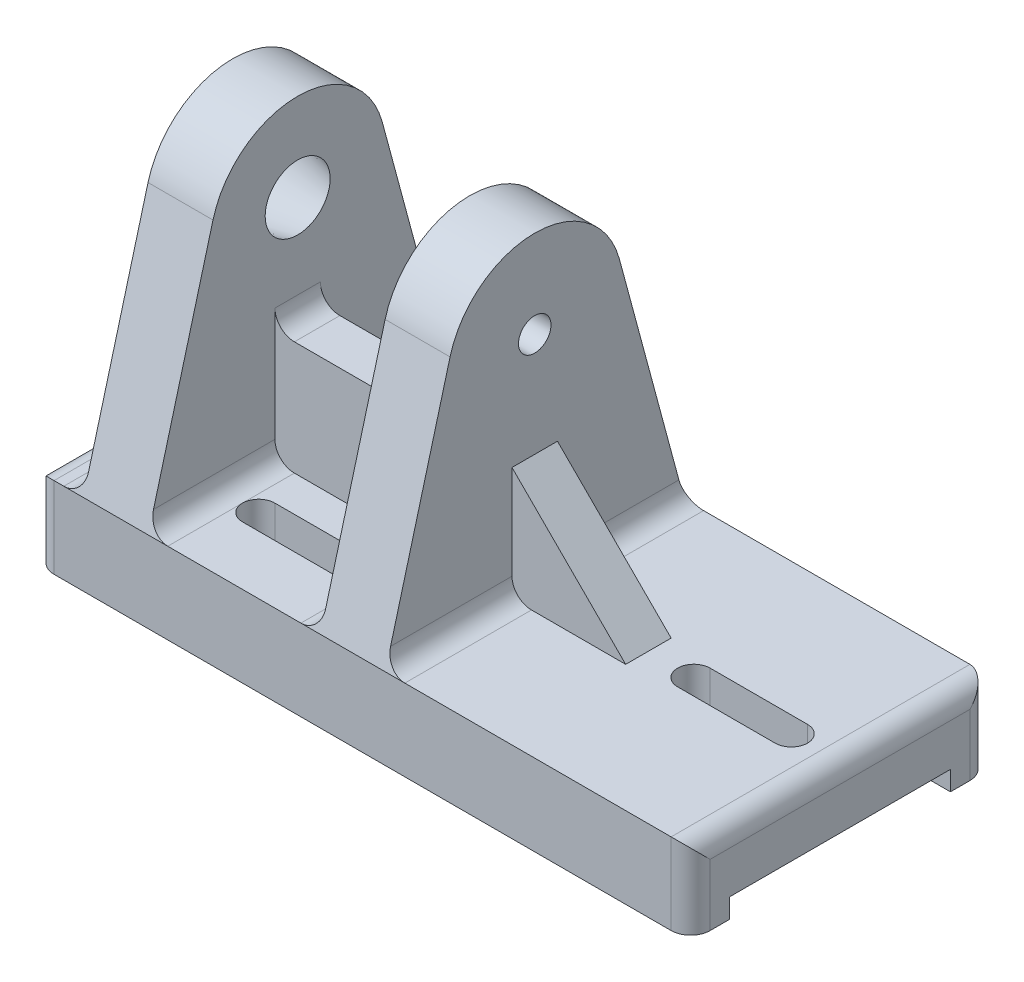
ISO-10303-21;
HEADER;
FILE_DESCRIPTION(('STEP AP214'),'2;1');
FILE_NAME('part.step','',(''),(''),'','','');
FILE_SCHEMA(('AUTOMOTIVE_DESIGN { 1 0 10303 214 1 1 1 1 }'));
ENDSEC;
DATA;
#1=APPLICATION_CONTEXT('core data for automotive mechanical design processes');
#2=APPLICATION_PROTOCOL_DEFINITION('international standard','automotive_design',2000,#1);
#3=PRODUCT_CONTEXT('',#1,'mechanical');
#4=PRODUCT('Part','Part','',(#3));
#5=PRODUCT_RELATED_PRODUCT_CATEGORY('part','',(#4));
#6=PRODUCT_DEFINITION_FORMATION('','',#4);
#7=PRODUCT_DEFINITION_CONTEXT('part definition',#1,'design');
#8=PRODUCT_DEFINITION('design','',#6,#7);
#9=PRODUCT_DEFINITION_SHAPE('','',#8);
#10=(LENGTH_UNIT() NAMED_UNIT(*) SI_UNIT(.MILLI.,.METRE.));
#11=(NAMED_UNIT(*) PLANE_ANGLE_UNIT() SI_UNIT($,.RADIAN.));
#12=(NAMED_UNIT(*) SI_UNIT($,.STERADIAN.) SOLID_ANGLE_UNIT());
#13=UNCERTAINTY_MEASURE_WITH_UNIT(LENGTH_MEASURE(1.E-05),#10,'distance_accuracy_value','');
#14=(GEOMETRIC_REPRESENTATION_CONTEXT(3) GLOBAL_UNCERTAINTY_ASSIGNED_CONTEXT((#13)) GLOBAL_UNIT_ASSIGNED_CONTEXT((#10,
#11,#12)) REPRESENTATION_CONTEXT('',''));
#15=CARTESIAN_POINT('',(0.,0.,0.));
#16=DIRECTION('',(0.,0.,1.));
#17=DIRECTION('',(1.,0.,0.));
#18=AXIS2_PLACEMENT_3D('',#15,#16,#17);
#19=CARTESIAN_POINT('',(0.,25.,-92.));
#20=DIRECTION('',(0.,-1.,0.));
#21=DIRECTION('',(0.,0.,-1.));
#22=AXIS2_PLACEMENT_3D('',#19,#20,#21);
#23=PLANE('',#22);
#24=DIRECTION('',(1.,0.,0.));
#25=VECTOR('',#24,1.);
#26=CARTESIAN_POINT('',(88.,25.,-53.));
#27=LINE('',#26,#25);
#28=CARTESIAN_POINT('',(41.,25.,-53.));
#29=VERTEX_POINT('',#28);
#30=CARTESIAN_POINT('',(82.,25.,-53.));
#31=VERTEX_POINT('',#30);
#32=EDGE_CURVE('E284',#29,#31,#27,.T.);
#33=ORIENTED_EDGE('',*,*,#32,.T.);
#34=DIRECTION('',(0.,0.,1.));
#35=VECTOR('',#34,1.);
#36=CARTESIAN_POINT('',(82.,25.,-92.));
#37=LINE('',#36,#35);
#38=CARTESIAN_POINT('',(82.,25.,-92.));
#39=VERTEX_POINT('',#38);
#40=EDGE_CURVE('E474',#31,#39,#37,.F.);
#41=ORIENTED_EDGE('',*,*,#40,.T.);
#42=DIRECTION('',(-1.,0.,0.));
#43=VECTOR('',#42,1.);
#44=CARTESIAN_POINT('',(0.,25.,-92.));
#45=LINE('',#44,#43);
#46=CARTESIAN_POINT('',(41.,25.,-92.));
#47=VERTEX_POINT('',#46);
#48=EDGE_CURVE('E467',#39,#47,#45,.T.);
#49=ORIENTED_EDGE('',*,*,#48,.T.);
#50=DIRECTION('',(0.,0.,-1.));
#51=VECTOR('',#50,1.);
#52=CARTESIAN_POINT('',(41.,25.,-53.));
#53=LINE('',#52,#51);
#54=CARTESIAN_POINT('',(41.,25.,-70.1163429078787));
#55=VERTEX_POINT('',#54);
#56=EDGE_CURVE('E472',#47,#55,#53,.F.);
#57=ORIENTED_EDGE('',*,*,#56,.T.);
#58=CARTESIAN_POINT('',(45.8737848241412,25.,-69.));
#59=DIRECTION('',(0.,1.,0.));
#60=DIRECTION('',(0.,0.,1.));
#61=AXIS2_PLACEMENT_3D('',#58,#59,#60);
#62=CIRCLE('',#61,5.);
#63=CARTESIAN_POINT('',(45.8737848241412,25.,-74.));
#64=VERTEX_POINT('',#63);
#65=EDGE_CURVE('E333',#64,#55,#62,.T.);
#66=ORIENTED_EDGE('',*,*,#65,.F.);
#67=DIRECTION('',(-1.,0.,0.));
#68=VECTOR('',#67,1.);
#69=CARTESIAN_POINT('',(45.8737848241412,25.,-74.));
#70=LINE('',#69,#68);
#71=CARTESIAN_POINT('',(75.8737848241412,25.,-74.));
#72=VERTEX_POINT('',#71);
#73=EDGE_CURVE('E343',#72,#64,#70,.T.);
#74=ORIENTED_EDGE('',*,*,#73,.F.);
#75=CARTESIAN_POINT('',(75.8737848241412,25.,-69.));
#76=DIRECTION('',(0.,1.,0.));
#77=DIRECTION('',(0.,0.,1.));
#78=AXIS2_PLACEMENT_3D('',#75,#76,#77);
#79=CIRCLE('',#78,5.);
#80=CARTESIAN_POINT('',(75.8737848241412,25.,-64.));
#81=VERTEX_POINT('',#80);
#82=EDGE_CURVE('E340',#81,#72,#79,.T.);
#83=ORIENTED_EDGE('',*,*,#82,.F.);
#84=DIRECTION('',(1.,0.,0.));
#85=VECTOR('',#84,1.);
#86=CARTESIAN_POINT('',(75.8737848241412,25.,-64.));
#87=LINE('',#86,#85);
#88=CARTESIAN_POINT('',(45.8737848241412,25.,-64.));
#89=VERTEX_POINT('',#88);
#90=EDGE_CURVE('E336',#89,#81,#87,.T.);
#91=ORIENTED_EDGE('',*,*,#90,.F.);
#92=CARTESIAN_POINT('',(41.,25.,-67.8836570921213));
#93=VERTEX_POINT('',#92);
#94=EDGE_CURVE('E149',#93,#89,#62,.T.);
#95=ORIENTED_EDGE('',*,*,#94,.F.);
#96=DIRECTION('',(0.,0.,-1.));
#97=VECTOR('',#96,1.);
#98=CARTESIAN_POINT('',(41.,25.,-53.));
#99=LINE('',#98,#97);
#100=EDGE_CURVE('E466',#93,#29,#99,.F.);
#101=ORIENTED_EDGE('',*,*,#100,.T.);
#102=EDGE_LOOP('',(#33,#41,#49,#57,#66,#74,#83,#91,#95,#101));
#103=FACE_BOUND('',#102,.T.);
#104=ADVANCED_FACE('F33',(#103),#23,.F.);
#105=CARTESIAN_POINT('',(35.,119.,0.));
#106=DIRECTION('',(-1.,0.,0.));
#107=DIRECTION('',(0.,0.,1.));
#108=AXIS2_PLACEMENT_3D('',#105,#106,#107);
#109=PLANE('',#108);
#110=CARTESIAN_POINT('',(35.,92.,-46.));
#111=DIRECTION('',(1.,0.,0.));
#112=DIRECTION('',(0.,0.,-1.));
#113=AXIS2_PLACEMENT_3D('',#110,#111,#112);
#114=CIRCLE('',#113,10.);
#115=CARTESIAN_POINT('',(35.,92.,-56.));
#116=VERTEX_POINT('',#115);
#117=EDGE_CURVE('E654',#116,#116,#114,.T.);
#118=ORIENTED_EDGE('',*,*,#117,.F.);
#119=EDGE_LOOP('',(#118));
#120=FACE_BOUND('',#119,.T.);
#121=DIRECTION('',(0.,-1.,0.));
#122=VECTOR('',#121,1.);
#123=CARTESIAN_POINT('',(35.,25.,-39.));
#124=LINE('',#123,#122);
#125=CARTESIAN_POINT('',(35.,66.,-39.));
#126=VERTEX_POINT('',#125);
#127=CARTESIAN_POINT('',(35.,31.,-39.));
#128=VERTEX_POINT('',#127);
#129=EDGE_CURVE('E269',#126,#128,#124,.T.);
#130=ORIENTED_EDGE('',*,*,#129,.F.);
#131=DIRECTION('',(0.,0.,1.));
#132=VECTOR('',#131,1.);
#133=CARTESIAN_POINT('',(35.,66.,0.));
#134=LINE('',#133,#132);
#135=CARTESIAN_POINT('',(35.,66.,-53.));
#136=VERTEX_POINT('',#135);
#137=EDGE_CURVE('E742',#126,#136,#134,.F.);
#138=ORIENTED_EDGE('',*,*,#137,.T.);
#139=DIRECTION('',(0.,-1.,0.));
#140=VECTOR('',#139,1.);
#141=CARTESIAN_POINT('',(35.,25.,-53.));
#142=LINE('',#141,#140);
#143=CARTESIAN_POINT('',(35.,31.,-53.));
#144=VERTEX_POINT('',#143);
#145=EDGE_CURVE('E281',#136,#144,#142,.T.);
#146=ORIENTED_EDGE('',*,*,#145,.T.);
#147=DIRECTION('',(0.,0.,-1.));
#148=VECTOR('',#147,1.);
#149=CARTESIAN_POINT('',(35.,31.,-92.));
#150=LINE('',#149,#148);
#151=CARTESIAN_POINT('',(35.,31.,-67.8836570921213));
#152=VERTEX_POINT('',#151);
#153=EDGE_CURVE('E736',#144,#152,#150,.T.);
#154=ORIENTED_EDGE('',*,*,#153,.T.);
#155=CARTESIAN_POINT('',(35.,30.9933369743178,-66.9621082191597));
#156=CARTESIAN_POINT('',(35.,24.7276452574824,-67.076115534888));
#157=CARTESIAN_POINT('',(41.2608057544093,25.,-67.0711599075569));
#158=CARTESIAN_POINT('',(35.,30.9948684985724,-67.0463273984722));
#159=CARTESIAN_POINT('',(35.,24.7584741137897,-67.1424788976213));
#160=CARTESIAN_POINT('',(41.2324372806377,25.,-67.138997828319));
#161=CARTESIAN_POINT('',(35.,30.9960564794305,-67.1305517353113));
#162=CARTESIAN_POINT('',(35.,24.787907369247,-67.2112887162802));
#163=CARTESIAN_POINT('',(41.2050372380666,25.,-67.2087430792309));
#164=CARTESIAN_POINT('',(35.,30.9978966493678,-67.2990047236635));
#165=CARTESIAN_POINT('',(35.,24.8434995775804,-67.3529832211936));
#166=CARTESIAN_POINT('',(41.1526285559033,25.,-67.3518230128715));
#167=CARTESIAN_POINT('',(35.,30.9985488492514,-67.3832333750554));
#168=CARTESIAN_POINT('',(35.,24.8696854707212,-67.4258806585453));
#169=CARTESIAN_POINT('',(41.1276198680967,25.,-67.4251576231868));
#170=CARTESIAN_POINT('',(35.,30.999928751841,-67.6359170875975));
#171=CARTESIAN_POINT('',(35.,24.9427800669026,-67.6495982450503));
#172=CARTESIAN_POINT('',(41.0568622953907,25.,-67.6502076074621));
#173=CARTESIAN_POINT('',(35.,31.0000798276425,-67.8043747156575));
#174=CARTESIAN_POINT('',(35.,24.9846751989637,-67.8064833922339));
#175=CARTESIAN_POINT('',(41.0153802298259,25.,-67.8069730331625));
#176=CARTESIAN_POINT('',(35.,30.9998591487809,-68.1411276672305));
#177=CARTESIAN_POINT('',(35.,25.0524628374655,-68.1302336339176));
#178=CARTESIAN_POINT('',(40.9471729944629,25.,-68.1306366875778));
#179=CARTESIAN_POINT('',(35.,30.999487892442,-68.309422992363));
#180=CARTESIAN_POINT('',(35.,25.0785441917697,-68.2974320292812));
#181=CARTESIAN_POINT('',(40.9204337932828,25.,-68.2975251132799));
#182=CARTESIAN_POINT('',(35.,30.9989011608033,-68.6460147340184));
#183=CARTESIAN_POINT('',(35.,25.1137459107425,-68.6368850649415));
#184=CARTESIAN_POINT('',(40.8840637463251,25.,-68.6369623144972));
#185=CARTESIAN_POINT('',(35.,30.998685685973,-68.8143111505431));
#186=CARTESIAN_POINT('',(35.,25.1229661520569,-68.8096016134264));
#187=CARTESIAN_POINT('',(40.8744329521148,25.,-68.809511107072));
#188=CARTESIAN_POINT('',(35.,30.9986603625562,-69.1498218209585));
#189=CARTESIAN_POINT('',(35.,25.1241439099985,-69.1536046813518));
#190=CARTESIAN_POINT('',(40.8732043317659,25.,-69.1536933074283));
#191=CARTESIAN_POINT('',(35.,30.9988479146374,-69.3170360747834));
#192=CARTESIAN_POINT('',(35.,25.116215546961,-69.3253926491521));
#193=CARTESIAN_POINT('',(40.8814909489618,25.,-69.3253254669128));
#194=CARTESIAN_POINT('',(35.,30.9994105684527,-69.6514647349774));
#195=CARTESIAN_POINT('',(35.,25.0837520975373,-69.6634491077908));
#196=CARTESIAN_POINT('',(40.9150764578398,25.,-69.6633880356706));
#197=CARTESIAN_POINT('',(35.,30.9997856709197,-69.8186791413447));
#198=CARTESIAN_POINT('',(35.,25.0591255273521,-69.8301767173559));
#199=CARTESIAN_POINT('',(40.940375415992,25.,-69.8298184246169));
#200=CARTESIAN_POINT('',(35.,31.0000884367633,-70.1532651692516));
#201=CARTESIAN_POINT('',(35.,24.9943331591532,-70.1534947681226));
#202=CARTESIAN_POINT('',(41.0057488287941,25.,-70.1530250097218));
#203=CARTESIAN_POINT('',(35.,31.0000156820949,-70.3206367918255));
#204=CARTESIAN_POINT('',(35.,24.9539869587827,-70.3104241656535));
#205=CARTESIAN_POINT('',(41.0458370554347,25.,-70.3097920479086));
#206=CARTESIAN_POINT('',(35.,30.9984522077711,-70.655378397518));
#207=CARTESIAN_POINT('',(35.,24.859429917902,-70.6098926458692));
#208=CARTESIAN_POINT('',(41.1375566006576,25.,-70.6102315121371));
#209=CARTESIAN_POINT('',(35.,30.9969614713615,-70.8227483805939));
#210=CARTESIAN_POINT('',(35.,24.8050129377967,-70.7526275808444));
#211=CARTESIAN_POINT('',(41.1891880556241,25.,-70.7539037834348));
#212=CARTESIAN_POINT('',(35.,30.9913370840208,-71.1599373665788));
#213=CARTESIAN_POINT('',(35.,24.6835436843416,-71.0224432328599));
#214=CARTESIAN_POINT('',(41.3012631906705,25.,-71.0283924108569));
#215=CARTESIAN_POINT('',(35.,30.9871645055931,-71.3297558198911));
#216=CARTESIAN_POINT('',(35.,24.6161090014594,-71.1492759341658));
#217=CARTESIAN_POINT('',(41.3618263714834,25.,-71.1589861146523));
#218=CARTESIAN_POINT('',(35.,30.9747989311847,-71.669253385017));
#219=CARTESIAN_POINT('',(35.,24.4717670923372,-71.382199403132));
#220=CARTESIAN_POINT('',(41.4876633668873,25.,-71.4043650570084));
#221=CARTESIAN_POINT('',(35.,30.9666060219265,-71.8389324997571));
#222=CARTESIAN_POINT('',(35.,24.3946760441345,-71.4881762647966));
#223=CARTESIAN_POINT('',(41.5529370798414,25.,-71.5191506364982));
#224=CARTESIAN_POINT('',(35.,30.9448757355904,-72.1775934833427));
#225=CARTESIAN_POINT('',(35.,24.2340878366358,-71.6774623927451));
#226=CARTESIAN_POINT('',(41.6850793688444,25.,-71.7332301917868));
#227=CARTESIAN_POINT('',(35.,30.9313499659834,-72.3465760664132));
#228=CARTESIAN_POINT('',(35.,24.1504765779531,-71.760597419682));
#229=CARTESIAN_POINT('',(41.7519441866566,25.,-71.8325571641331));
#230=CARTESIAN_POINT('',(35.,30.8976786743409,-72.6839057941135));
#231=CARTESIAN_POINT('',(35.,23.9797715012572,-71.9035461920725));
#232=CARTESIAN_POINT('',(41.885110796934,25.,-72.0171908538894));
#233=CARTESIAN_POINT('',(35.,30.8775328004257,-72.8522529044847));
#234=CARTESIAN_POINT('',(35.,23.8926201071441,-71.9630651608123));
#235=CARTESIAN_POINT('',(41.9514125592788,25.,-72.1024968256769));
#236=CARTESIAN_POINT('',(35.,30.8292921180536,-73.1890028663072));
#237=CARTESIAN_POINT('',(35.,23.7174379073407,-72.0588347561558));
#238=CARTESIAN_POINT('',(42.0822342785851,25.,-72.2611024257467));
#239=CARTESIAN_POINT('',(35.,30.8011437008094,-73.3573981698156));
#240=CARTESIAN_POINT('',(35.,23.6294264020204,-72.0945910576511));
#241=CARTESIAN_POINT('',(42.1467388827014,25.,-72.3343156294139));
#242=CARTESIAN_POINT('',(35.,30.7359239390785,-73.692427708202));
#243=CARTESIAN_POINT('',(35.,23.4564585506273,-72.1425644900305));
#244=CARTESIAN_POINT('',(42.2723377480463,25.,-72.4695942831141));
#245=CARTESIAN_POINT('',(35.,30.6988547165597,-73.8590623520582));
#246=CARTESIAN_POINT('',(35.,23.3715808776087,-72.1544639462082));
#247=CARTESIAN_POINT('',(42.3334328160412,25.,-72.5316623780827));
#248=CARTESIAN_POINT('',(35.,30.6145626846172,-74.1912083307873));
#249=CARTESIAN_POINT('',(35.,23.2074835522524,-72.1557453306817));
#250=CARTESIAN_POINT('',(42.4519965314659,25.,-72.64668028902));
#251=CARTESIAN_POINT('',(35.,30.5672600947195,-74.3566996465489));
#252=CARTESIAN_POINT('',(35.,23.1284620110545,-72.1446453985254));
#253=CARTESIAN_POINT('',(42.5094318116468,25.,-72.6995522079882));
#254=CARTESIAN_POINT('',(35.,30.4619591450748,-74.6844124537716));
#255=CARTESIAN_POINT('',(35.,22.9798774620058,-72.1012399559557));
#256=CARTESIAN_POINT('',(42.6198557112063,25.,-72.7970030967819));
#257=CARTESIAN_POINT('',(35.,30.4039503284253,-74.8466305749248));
#258=CARTESIAN_POINT('',(35.,22.9105041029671,-72.0686636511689));
#259=CARTESIAN_POINT('',(42.6728399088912,25.,-72.8415738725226));
#260=CARTESIAN_POINT('',(35.,30.3402726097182,-75.0066646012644));
#261=CARTESIAN_POINT('',(35.,22.847950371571,-72.0267273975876));
#262=CARTESIAN_POINT('',(42.7234039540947,25.,-72.8826666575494));
#263=(BOUNDED_SURFACE() B_SPLINE_SURFACE(3,2,((#155,#156,#157),(#158,#159,#160),(#161,#162,
#163),(#164,#165,#166),(#167,#168,#169),(#170,#171,#172),(#173,#174,#175),(#176,#177,#178),
(#179,#180,#181),(#182,#183,#184),(#185,#186,#187),(#188,#189,#190),(#191,#192,#193),(#194,#195,
#196),(#197,#198,#199),(#200,#201,#202),(#203,#204,#205),(#206,#207,#208),(#209,#210,#211),
(#212,#213,#214),(#215,#216,#217),(#218,#219,#220),(#221,#222,#223),(#224,#225,#226),(#227,#228,
#229),(#230,#231,#232),(#233,#234,#235),(#236,#237,#238),(#239,#240,#241),(#242,#243,#244),
(#245,#246,#247),(#248,#249,#250),(#251,#252,#253),(#254,#255,#256),(#257,#258,#259),(#260,#261,
#262)),.UNSPECIFIED.,.F.,.F.,.F.) B_SPLINE_SURFACE_WITH_KNOTS((4,2,2,2,2,2,2,2,2,2,2,2,2,2,2,2,
2,4),(3,3),(0.,0.252697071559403,0.505389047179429,1.0107585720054,1.51564628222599,
2.02053551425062,2.52217822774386,3.02382290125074,3.52593589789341,4.02805482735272,
4.53763195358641,5.04719808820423,5.55566117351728,6.06415128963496,6.57613144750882,
7.08798994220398,7.60399280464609,8.12050234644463),(0.,1.),
.UNSPECIFIED.) GEOMETRIC_REPRESENTATION_ITEM() RATIONAL_B_SPLINE_SURFACE(((1.,0.691567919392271,
1.),(1.,0.693277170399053,1.),(1.,0.69492160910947,1.),(1.,0.698056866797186,1.),(1.,
0.699547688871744,1.),(1.,0.703753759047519,1.),(1.,0.706202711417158,1.),(1.,0.710215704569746,
1.),(1.,0.711780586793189,1.),(1.,0.713906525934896,1.),(1.,0.714467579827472,1.),(1.,
0.714539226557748,1.),(1.,0.714056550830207,1.),(1.,0.712094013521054,1.),(1.,0.710614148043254,
1.),(1.,0.706770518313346,1.),(1.,0.704405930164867,1.),(1.,0.698959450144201,1.),(1.,
0.695877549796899,1.),(1.,0.689134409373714,1.),(1.,0.685465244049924,1.),(1.,0.677772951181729,
1.),(1.,0.673749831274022,1.),(1.,0.66552755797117,1.),(1.,0.661328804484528,1.),(1.,
0.652884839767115,1.),(1.,0.648639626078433,1.),(1.,0.640181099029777,1.),(1.,0.635968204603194,
1.),(1.,0.62768545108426,1.),(1.,0.623615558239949,1.),(1.,0.615643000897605,1.),(1.,
0.61174195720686,1.),(1.,0.604174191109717,1.),(1.,0.600507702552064,1.),(1.,0.596978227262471,1.))) REPRESENTATION_ITEM('') SURFACE());
#264=CARTESIAN_POINT('',(35.,30.9933369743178,-66.9621082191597));
#265=CARTESIAN_POINT('',(35.,30.9948684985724,-67.0463273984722));
#266=CARTESIAN_POINT('',(35.,30.9960564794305,-67.1305517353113));
#267=CARTESIAN_POINT('',(35.,30.9978966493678,-67.2990047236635));
#268=CARTESIAN_POINT('',(35.,30.9985488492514,-67.3832333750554));
#269=CARTESIAN_POINT('',(35.,30.999928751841,-67.6359170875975));
#270=CARTESIAN_POINT('',(35.,31.0000798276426,-67.8043747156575));
#271=CARTESIAN_POINT('',(35.,30.9998591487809,-68.1411276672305));
#272=CARTESIAN_POINT('',(35.,30.999487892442,-68.309422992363));
#273=CARTESIAN_POINT('',(35.,30.9989011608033,-68.6460147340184));
#274=CARTESIAN_POINT('',(35.,30.998685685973,-68.814311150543));
#275=CARTESIAN_POINT('',(35.,30.9986603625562,-69.1498218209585));
#276=CARTESIAN_POINT('',(35.,30.9988479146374,-69.3170360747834));
#277=CARTESIAN_POINT('',(35.,30.9994105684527,-69.6514647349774));
#278=CARTESIAN_POINT('',(35.,30.9997856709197,-69.8186791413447));
#279=CARTESIAN_POINT('',(35.,31.0000884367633,-70.1532651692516));
#280=CARTESIAN_POINT('',(35.,31.0000156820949,-70.3206367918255));
#281=CARTESIAN_POINT('',(35.,30.9984522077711,-70.655378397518));
#282=CARTESIAN_POINT('',(35.,30.9969614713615,-70.8227483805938));
#283=CARTESIAN_POINT('',(35.,30.9913370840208,-71.1599373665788));
#284=CARTESIAN_POINT('',(35.,30.9871645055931,-71.3297558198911));
#285=CARTESIAN_POINT('',(35.,30.9747989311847,-71.669253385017));
#286=CARTESIAN_POINT('',(35.,30.9666060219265,-71.8389324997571));
#287=CARTESIAN_POINT('',(35.,30.9448757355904,-72.1775934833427));
#288=CARTESIAN_POINT('',(35.,30.9313499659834,-72.3465760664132));
#289=CARTESIAN_POINT('',(35.,30.8976786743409,-72.6839057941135));
#290=CARTESIAN_POINT('',(35.,30.8775328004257,-72.8522529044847));
#291=CARTESIAN_POINT('',(35.,30.8292921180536,-73.1890028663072));
#292=CARTESIAN_POINT('',(35.,30.8011437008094,-73.3573981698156));
#293=CARTESIAN_POINT('',(35.,30.7359239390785,-73.692427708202));
#294=CARTESIAN_POINT('',(35.,30.6988547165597,-73.8590623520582));
#295=CARTESIAN_POINT('',(35.,30.6145626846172,-74.1912083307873));
#296=CARTESIAN_POINT('',(35.,30.5672600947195,-74.3566996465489));
#297=CARTESIAN_POINT('',(35.,30.4619591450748,-74.6844124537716));
#298=CARTESIAN_POINT('',(35.,30.4039503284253,-74.8466305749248));
#299=CARTESIAN_POINT('',(35.,30.3402726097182,-75.0066646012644));
#300=B_SPLINE_CURVE_WITH_KNOTS('',3,(#264,#265,#266,#267,#268,#269,#270,#271,#272,#273,#274,
#275,#276,#277,#278,#279,#280,#281,#282,#283,#284,#285,#286,#287,#288,#289,#290,#291,#292,#293,
#294,#295,#296,#297,#298,#299),.UNSPECIFIED.,.F.,.F.,(4,2,2,2,2,2,2,2,2,2,2,2,2,2,2,2,2,4),(0.,
0.252697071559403,0.505389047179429,1.0107585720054,1.51564628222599,2.02053551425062,
2.52217822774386,3.02382290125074,3.52593589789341,4.02805482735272,4.53763195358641,
5.04719808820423,5.55566117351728,6.06415128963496,6.57613144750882,7.08798994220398,
7.60399280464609,8.12050234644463),.UNSPECIFIED.);
#301=CARTESIAN_POINT('',(35.,31.,-70.1163429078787));
#302=VERTEX_POINT('',#301);
#303=EDGE_CURVE('E730',#152,#302,#300,.T.);
#304=ORIENTED_EDGE('',*,*,#303,.T.);
#305=DIRECTION('',(0.,0.,-1.));
#306=VECTOR('',#305,1.);
#307=CARTESIAN_POINT('',(35.,31.,-92.));
#308=LINE('',#307,#306);
#309=CARTESIAN_POINT('',(35.,31.,-90.3846068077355));
#310=VERTEX_POINT('',#309);
#311=EDGE_CURVE('E256',#302,#310,#308,.T.);
#312=ORIENTED_EDGE('',*,*,#311,.T.);
#313=DIRECTION('',(0.,0.965615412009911,0.259974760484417));
#314=VECTOR('',#313,1.);
#315=CARTESIAN_POINT('',(35.,135.742112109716,-62.1846576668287));
#316=LINE('',#315,#314);
#317=CARTESIAN_POINT('',(35.,99.0193185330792,-72.0716161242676));
#318=VERTEX_POINT('',#317);
#319=EDGE_CURVE('E241',#310,#318,#316,.T.);
#320=ORIENTED_EDGE('',*,*,#319,.T.);
#321=CARTESIAN_POINT('',(35.,92.,-46.));
#322=DIRECTION('',(-1.,0.,0.));
#323=DIRECTION('',(0.,0.,1.));
#324=AXIS2_PLACEMENT_3D('',#321,#322,#323);
#325=CIRCLE('',#324,27.);
#326=CARTESIAN_POINT('',(35.,99.0193185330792,-19.9283838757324));
#327=VERTEX_POINT('',#326);
#328=EDGE_CURVE('E220',#318,#327,#325,.F.);
#329=ORIENTED_EDGE('',*,*,#328,.T.);
#330=DIRECTION('',(0.,-0.965615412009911,0.259974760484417));
#331=VECTOR('',#330,1.);
#332=CARTESIAN_POINT('',(35.,112.646833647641,-23.5973497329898));
#333=LINE('',#332,#331);
#334=CARTESIAN_POINT('',(35.,31.,-1.6153931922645));
#335=VERTEX_POINT('',#334);
#336=EDGE_CURVE('E250',#327,#335,#333,.T.);
#337=ORIENTED_EDGE('',*,*,#336,.T.);
#338=DIRECTION('',(0.,0.,-1.));
#339=VECTOR('',#338,1.);
#340=CARTESIAN_POINT('',(35.,31.,-39.));
#341=LINE('',#340,#339);
#342=EDGE_CURVE('E739',#335,#128,#341,.T.);
#343=ORIENTED_EDGE('',*,*,#342,.T.);
#344=EDGE_LOOP('',(#130,#138,#146,#154,#304,#312,#320,#329,#337,#343));
#345=FACE_BOUND('',#344,.T.);
#346=ADVANCED_FACE('F717',(#120,#345),#109,.F.);
#347=CARTESIAN_POINT('',(88.,119.,0.));
#348=DIRECTION('',(1.,0.,0.));
#349=DIRECTION('',(0.,0.,-1.));
#350=AXIS2_PLACEMENT_3D('',#347,#348,#349);
#351=PLANE('',#350);
#352=CARTESIAN_POINT('',(88.,92.,-46.));
#353=DIRECTION('',(-1.,0.,0.));
#354=DIRECTION('',(0.,0.,1.));
#355=AXIS2_PLACEMENT_3D('',#352,#353,#354);
#356=CIRCLE('',#355,10.);
#357=CARTESIAN_POINT('',(88.,92.,-36.));
#358=VERTEX_POINT('',#357);
#359=EDGE_CURVE('E1542',#358,#358,#356,.T.);
#360=ORIENTED_EDGE('',*,*,#359,.F.);
#361=EDGE_LOOP('',(#360));
#362=FACE_BOUND('',#361,.T.);
#363=DIRECTION('',(0.,0.,1.));
#364=VECTOR('',#363,1.);
#365=CARTESIAN_POINT('',(88.,66.,0.));
#366=LINE('',#365,#364);
#367=CARTESIAN_POINT('',(88.,66.,-53.));
#368=VERTEX_POINT('',#367);
#369=CARTESIAN_POINT('',(88.,66.,-39.));
#370=VERTEX_POINT('',#369);
#371=EDGE_CURVE('E443',#368,#370,#366,.T.);
#372=ORIENTED_EDGE('',*,*,#371,.T.);
#373=DIRECTION('',(0.,1.,0.));
#374=VECTOR('',#373,1.);
#375=CARTESIAN_POINT('',(88.,25.,-39.));
#376=LINE('',#375,#374);
#377=CARTESIAN_POINT('',(88.,31.,-39.));
#378=VERTEX_POINT('',#377);
#379=EDGE_CURVE('E261',#378,#370,#376,.T.);
#380=ORIENTED_EDGE('',*,*,#379,.F.);
#381=DIRECTION('',(0.,0.,1.));
#382=VECTOR('',#381,1.);
#383=CARTESIAN_POINT('',(88.,31.,0.));
#384=LINE('',#383,#382);
#385=CARTESIAN_POINT('',(88.,31.,-1.6153931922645));
#386=VERTEX_POINT('',#385);
#387=EDGE_CURVE('E746',#378,#386,#384,.T.);
#388=ORIENTED_EDGE('',*,*,#387,.T.);
#389=DIRECTION('',(0.,0.965615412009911,-0.259974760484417));
#390=VECTOR('',#389,1.);
#391=CARTESIAN_POINT('',(88.,112.646833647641,-23.5973497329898));
#392=LINE('',#391,#390);
#393=CARTESIAN_POINT('',(88.,99.0193185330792,-19.9283838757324));
#394=VERTEX_POINT('',#393);
#395=EDGE_CURVE('E245',#386,#394,#392,.T.);
#396=ORIENTED_EDGE('',*,*,#395,.T.);
#397=CARTESIAN_POINT('',(88.,92.,-46.));
#398=DIRECTION('',(1.,0.,0.));
#399=DIRECTION('',(0.,0.,-1.));
#400=AXIS2_PLACEMENT_3D('',#397,#398,#399);
#401=CIRCLE('',#400,27.);
#402=CARTESIAN_POINT('',(88.,99.0193185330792,-72.0716161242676));
#403=VERTEX_POINT('',#402);
#404=EDGE_CURVE('E213',#394,#403,#401,.F.);
#405=ORIENTED_EDGE('',*,*,#404,.T.);
#406=DIRECTION('',(0.,-0.965615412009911,-0.259974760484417));
#407=VECTOR('',#406,1.);
#408=CARTESIAN_POINT('',(88.,135.742112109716,-62.1846576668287));
#409=LINE('',#408,#407);
#410=CARTESIAN_POINT('',(88.,31.,-90.3846068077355));
#411=VERTEX_POINT('',#410);
#412=EDGE_CURVE('E224',#403,#411,#409,.T.);
#413=ORIENTED_EDGE('',*,*,#412,.T.);
#414=DIRECTION('',(0.,0.,1.));
#415=VECTOR('',#414,1.);
#416=CARTESIAN_POINT('',(88.,31.,-53.));
#417=LINE('',#416,#415);
#418=CARTESIAN_POINT('',(88.,31.,-53.));
#419=VERTEX_POINT('',#418);
#420=EDGE_CURVE('E745',#411,#419,#417,.T.);
#421=ORIENTED_EDGE('',*,*,#420,.T.);
#422=DIRECTION('',(0.,1.,0.));
#423=VECTOR('',#422,1.);
#424=CARTESIAN_POINT('',(88.,25.,-53.));
#425=LINE('',#424,#423);
#426=EDGE_CURVE('E275',#419,#368,#425,.T.);
#427=ORIENTED_EDGE('',*,*,#426,.T.);
#428=EDGE_LOOP('',(#372,#380,#388,#396,#405,#413,#421,#427));
#429=FACE_BOUND('',#428,.T.);
#430=ADVANCED_FACE('F713',(#362,#429),#351,.F.);
#431=DIRECTION('',(1.,0.,0.));
#432=VECTOR('',#431,1.);
#433=CARTESIAN_POINT('',(187.,25.,-41.));
#434=LINE('',#433,#432);
#435=CARTESIAN_POINT('',(157.,25.,-41.));
#436=VERTEX_POINT('',#435);
#437=CARTESIAN_POINT('',(187.,25.,-41.));
#438=VERTEX_POINT('',#437);
#439=EDGE_CURVE('E361',#436,#438,#434,.T.);
#440=ORIENTED_EDGE('',*,*,#439,.F.);
#441=CARTESIAN_POINT('',(157.,25.,-46.));
#442=DIRECTION('',(0.,1.,0.));
#443=DIRECTION('',(0.,0.,1.));
#444=AXIS2_PLACEMENT_3D('',#441,#442,#443);
#445=CIRCLE('',#444,5.);
#446=CARTESIAN_POINT('',(157.,25.,-51.));
#447=VERTEX_POINT('',#446);
#448=EDGE_CURVE('E350',#447,#436,#445,.T.);
#449=ORIENTED_EDGE('',*,*,#448,.F.);
#450=DIRECTION('',(-1.,0.,0.));
#451=VECTOR('',#450,1.);
#452=CARTESIAN_POINT('',(157.,25.,-51.));
#453=LINE('',#452,#451);
#454=CARTESIAN_POINT('',(187.,25.,-51.));
#455=VERTEX_POINT('',#454);
#456=EDGE_CURVE('E367',#455,#447,#453,.T.);
#457=ORIENTED_EDGE('',*,*,#456,.F.);
#458=CARTESIAN_POINT('',(187.,25.,-46.));
#459=DIRECTION('',(0.,1.,0.));
#460=DIRECTION('',(0.,0.,1.));
#461=AXIS2_PLACEMENT_3D('',#458,#459,#460);
#462=CIRCLE('',#461,4.99999999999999);
#463=EDGE_CURVE('E364',#438,#455,#462,.T.);
#464=ORIENTED_EDGE('',*,*,#463,.F.);
#465=EDGE_LOOP('',(#440,#449,#457,#464));
#466=FACE_BOUND('',#465,.T.);
#467=DIRECTION('',(1.,0.,0.));
#468=VECTOR('',#467,1.);
#469=CARTESIAN_POINT('',(108.,25.,-39.));
#470=LINE('',#469,#468);
#471=CARTESIAN_POINT('',(114.,25.,-39.));
#472=VERTEX_POINT('',#471);
#473=CARTESIAN_POINT('',(143.,25.,-39.));
#474=VERTEX_POINT('',#473);
#475=EDGE_CURVE('E290',#472,#474,#470,.T.);
#476=ORIENTED_EDGE('',*,*,#475,.F.);
#477=DIRECTION('',(0.,0.,-1.));
#478=VECTOR('',#477,1.);
#479=CARTESIAN_POINT('',(114.,25.,0.));
#480=LINE('',#479,#478);
#481=CARTESIAN_POINT('',(114.,25.,0.));
#482=VERTEX_POINT('',#481);
#483=EDGE_CURVE('E542',#472,#482,#480,.F.);
#484=ORIENTED_EDGE('',*,*,#483,.T.);
#485=DIRECTION('',(1.,0.,0.));
#486=VECTOR('',#485,1.);
#487=CARTESIAN_POINT('',(0.,25.,0.));
#488=LINE('',#487,#486);
#489=CARTESIAN_POINT('',(196.,25.,0.));
#490=VERTEX_POINT('',#489);
#491=EDGE_CURVE('E426',#482,#490,#488,.T.);
#492=ORIENTED_EDGE('',*,*,#491,.T.);
#493=DIRECTION('',(0.,0.,-1.));
#494=VECTOR('',#493,1.);
#495=CARTESIAN_POINT('',(196.,25.,-92.));
#496=LINE('',#495,#494);
#497=CARTESIAN_POINT('',(196.,25.,-92.));
#498=VERTEX_POINT('',#497);
#499=EDGE_CURVE('E538',#490,#498,#496,.T.);
#500=ORIENTED_EDGE('',*,*,#499,.T.);
#501=CARTESIAN_POINT('',(114.,25.,-92.));
#502=VERTEX_POINT('',#501);
#503=EDGE_CURVE('E469',#498,#502,#45,.T.);
#504=ORIENTED_EDGE('',*,*,#503,.T.);
#505=DIRECTION('',(0.,0.,-1.));
#506=VECTOR('',#505,1.);
#507=CARTESIAN_POINT('',(114.,25.,-53.));
#508=LINE('',#507,#506);
#509=CARTESIAN_POINT('',(114.,25.,-53.));
#510=VERTEX_POINT('',#509);
#511=EDGE_CURVE('E82',#502,#510,#508,.F.);
#512=ORIENTED_EDGE('',*,*,#511,.T.);
#513=DIRECTION('',(1.,0.,0.));
#514=VECTOR('',#513,1.);
#515=CARTESIAN_POINT('',(108.,25.,-53.));
#516=LINE('',#515,#514);
#517=CARTESIAN_POINT('',(143.,25.,-53.));
#518=VERTEX_POINT('',#517);
#519=EDGE_CURVE('E297',#510,#518,#516,.T.);
#520=ORIENTED_EDGE('',*,*,#519,.T.);
#521=DIRECTION('',(0.,0.,1.));
#522=VECTOR('',#521,1.);
#523=CARTESIAN_POINT('',(143.,25.,-53.));
#524=LINE('',#523,#522);
#525=EDGE_CURVE('E302',#518,#474,#524,.T.);
#526=ORIENTED_EDGE('',*,*,#525,.T.);
#527=EDGE_LOOP('',(#476,#484,#492,#500,#504,#512,#520,#526));
#528=FACE_BOUND('',#527,.T.);
#529=ADVANCED_FACE('F716',(#466,#528),#23,.F.);
#530=CARTESIAN_POINT('',(108.,119.,0.));
#531=DIRECTION('',(-1.,0.,0.));
#532=DIRECTION('',(0.,0.,1.));
#533=AXIS2_PLACEMENT_3D('',#530,#531,#532);
#534=PLANE('',#533);
#535=CARTESIAN_POINT('',(108.,92.,-46.));
#536=DIRECTION('',(1.,0.,0.));
#537=DIRECTION('',(0.,0.,-1.));
#538=AXIS2_PLACEMENT_3D('',#535,#536,#537);
#539=CIRCLE('',#538,5.);
#540=CARTESIAN_POINT('',(108.,92.,-51.));
#541=VERTEX_POINT('',#540);
#542=EDGE_CURVE('E1546',#541,#541,#539,.T.);
#543=ORIENTED_EDGE('',*,*,#542,.F.);
#544=EDGE_LOOP('',(#543));
#545=FACE_BOUND('',#544,.T.);
#546=DIRECTION('',(0.,-0.965615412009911,0.259974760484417));
#547=VECTOR('',#546,1.);
#548=CARTESIAN_POINT('',(108.,25.,0.));
#549=LINE('',#548,#547);
#550=CARTESIAN_POINT('',(108.,99.0193185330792,-19.9283838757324));
#551=VERTEX_POINT('',#550);
#552=CARTESIAN_POINT('',(108.,31.,-1.6153931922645));
#553=VERTEX_POINT('',#552);
#554=EDGE_CURVE('E202',#551,#553,#549,.T.);
#555=ORIENTED_EDGE('',*,*,#554,.T.);
#556=DIRECTION('',(0.,0.,-1.));
#557=VECTOR('',#556,1.);
#558=CARTESIAN_POINT('',(108.,31.,-39.));
#559=LINE('',#558,#557);
#560=CARTESIAN_POINT('',(108.,31.,-39.));
#561=VERTEX_POINT('',#560);
#562=EDGE_CURVE('E191',#553,#561,#559,.T.);
#563=ORIENTED_EDGE('',*,*,#562,.T.);
#564=DIRECTION('',(0.,-1.,0.));
#565=VECTOR('',#564,1.);
#566=CARTESIAN_POINT('',(108.,60.,-39.));
#567=LINE('',#566,#565);
#568=CARTESIAN_POINT('',(108.,60.,-39.));
#569=VERTEX_POINT('',#568);
#570=EDGE_CURVE('E287',#569,#561,#567,.T.);
#571=ORIENTED_EDGE('',*,*,#570,.F.);
#572=DIRECTION('',(0.,0.,1.));
#573=VECTOR('',#572,1.);
#574=CARTESIAN_POINT('',(108.,60.,-53.));
#575=LINE('',#574,#573);
#576=CARTESIAN_POINT('',(108.,60.,-53.));
#577=VERTEX_POINT('',#576);
#578=EDGE_CURVE('E303',#577,#569,#575,.T.);
#579=ORIENTED_EDGE('',*,*,#578,.F.);
#580=DIRECTION('',(0.,-1.,0.));
#581=VECTOR('',#580,1.);
#582=CARTESIAN_POINT('',(108.,60.,-53.));
#583=LINE('',#582,#581);
#584=CARTESIAN_POINT('',(108.,31.,-53.));
#585=VERTEX_POINT('',#584);
#586=EDGE_CURVE('E190',#577,#585,#583,.T.);
#587=ORIENTED_EDGE('',*,*,#586,.T.);
#588=DIRECTION('',(0.,0.,-1.));
#589=VECTOR('',#588,1.);
#590=CARTESIAN_POINT('',(108.,31.,-92.));
#591=LINE('',#590,#589);
#592=CARTESIAN_POINT('',(108.,31.,-90.3846068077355));
#593=VERTEX_POINT('',#592);
#594=EDGE_CURVE('E177',#585,#593,#591,.T.);
#595=ORIENTED_EDGE('',*,*,#594,.T.);
#596=DIRECTION('',(0.,0.965615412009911,0.259974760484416));
#597=VECTOR('',#596,1.);
#598=CARTESIAN_POINT('',(108.,25.,-92.));
#599=LINE('',#598,#597);
#600=CARTESIAN_POINT('',(108.,99.0193185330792,-72.0716161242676));
#601=VERTEX_POINT('',#600);
#602=EDGE_CURVE('E186',#593,#601,#599,.T.);
#603=ORIENTED_EDGE('',*,*,#602,.T.);
#604=CARTESIAN_POINT('',(108.,92.,-46.));
#605=DIRECTION('',(1.,0.,0.));
#606=DIRECTION('',(0.,0.,1.));
#607=AXIS2_PLACEMENT_3D('',#604,#605,#606);
#608=CIRCLE('',#607,27.);
#609=EDGE_CURVE('E199',#601,#551,#608,.T.);
#610=ORIENTED_EDGE('',*,*,#609,.T.);
#611=EDGE_LOOP('',(#555,#563,#571,#579,#587,#595,#603,#610));
#612=FACE_BOUND('',#611,.T.);
#613=ADVANCED_FACE('F183',(#545,#612),#534,.F.);
#614=CARTESIAN_POINT('',(0.,0.,-92.));
#615=DIRECTION('',(0.,-1.,0.));
#616=DIRECTION('',(0.,0.,-1.));
#617=AXIS2_PLACEMENT_3D('',#614,#615,#616);
#618=PLANE('',#617);
#619=DIRECTION('',(0.,0.,-1.));
#620=VECTOR('',#619,1.);
#621=CARTESIAN_POINT('',(202.,0.,0.));
#622=LINE('',#621,#620);
#623=CARTESIAN_POINT('',(202.,0.,-6.));
#624=VERTEX_POINT('',#623);
#625=CARTESIAN_POINT('',(202.,0.,-12.));
#626=VERTEX_POINT('',#625);
#627=EDGE_CURVE('E420',#624,#626,#622,.T.);
#628=ORIENTED_EDGE('',*,*,#627,.F.);
#629=CARTESIAN_POINT('',(196.,0.,-6.));
#630=DIRECTION('',(0.,-1.,0.));
#631=DIRECTION('',(0.,0.,-1.));
#632=AXIS2_PLACEMENT_3D('',#629,#630,#631);
#633=CIRCLE('',#632,6.);
#634=CARTESIAN_POINT('',(196.,0.,0.));
#635=VERTEX_POINT('',#634);
#636=EDGE_CURVE('E563',#624,#635,#633,.T.);
#637=ORIENTED_EDGE('',*,*,#636,.T.);
#638=DIRECTION('',(1.,0.,0.));
#639=VECTOR('',#638,1.);
#640=CARTESIAN_POINT('',(0.,0.,0.));
#641=LINE('',#640,#639);
#642=CARTESIAN_POINT('',(6.,0.,0.));
#643=VERTEX_POINT('',#642);
#644=EDGE_CURVE('E416',#643,#635,#641,.T.);
#645=ORIENTED_EDGE('',*,*,#644,.F.);
#646=CARTESIAN_POINT('',(6.,0.,-6.));
#647=DIRECTION('',(0.,-1.,0.));
#648=DIRECTION('',(0.,0.,-1.));
#649=AXIS2_PLACEMENT_3D('',#646,#647,#648);
#650=CIRCLE('',#649,6.);
#651=CARTESIAN_POINT('',(0.,0.,-6.));
#652=VERTEX_POINT('',#651);
#653=EDGE_CURVE('E561',#643,#652,#650,.T.);
#654=ORIENTED_EDGE('',*,*,#653,.T.);
#655=DIRECTION('',(0.,0.,1.));
#656=VECTOR('',#655,1.);
#657=CARTESIAN_POINT('',(0.,0.,0.));
#658=LINE('',#657,#656);
#659=CARTESIAN_POINT('',(0.,0.,-12.));
#660=VERTEX_POINT('',#659);
#661=EDGE_CURVE('E404',#660,#652,#658,.T.);
#662=ORIENTED_EDGE('',*,*,#661,.F.);
#663=DIRECTION('',(-1.,0.,0.));
#664=VECTOR('',#663,1.);
#665=CARTESIAN_POINT('',(0.,0.,-12.));
#666=LINE('',#665,#664);
#667=EDGE_CURVE('E385',#626,#660,#666,.T.);
#668=ORIENTED_EDGE('',*,*,#667,.F.);
#669=EDGE_LOOP('',(#628,#637,#645,#654,#662,#668));
#670=FACE_BOUND('',#669,.T.);
#671=ADVANCED_FACE('F721',(#670),#618,.T.);
#672=CARTESIAN_POINT('',(41.,25.,0.));
#673=VERTEX_POINT('',#672);
#674=CARTESIAN_POINT('',(82.,25.,0.));
#675=VERTEX_POINT('',#674);
#676=EDGE_CURVE('E438',#673,#675,#488,.T.);
#677=ORIENTED_EDGE('',*,*,#676,.T.);
#678=DIRECTION('',(0.,0.,1.));
#679=VECTOR('',#678,1.);
#680=CARTESIAN_POINT('',(82.,25.,-39.));
#681=LINE('',#680,#679);
#682=CARTESIAN_POINT('',(82.,25.,-39.));
#683=VERTEX_POINT('',#682);
#684=EDGE_CURVE('E451',#675,#683,#681,.F.);
#685=ORIENTED_EDGE('',*,*,#684,.T.);
#686=DIRECTION('',(1.,0.,0.));
#687=VECTOR('',#686,1.);
#688=CARTESIAN_POINT('',(88.,25.,-39.));
#689=LINE('',#688,#687);
#690=CARTESIAN_POINT('',(41.,25.,-39.));
#691=VERTEX_POINT('',#690);
#692=EDGE_CURVE('E272',#691,#683,#689,.T.);
#693=ORIENTED_EDGE('',*,*,#692,.F.);
#694=DIRECTION('',(0.,0.,-1.));
#695=VECTOR('',#694,1.);
#696=CARTESIAN_POINT('',(41.,25.,0.));
#697=LINE('',#696,#695);
#698=CARTESIAN_POINT('',(41.,25.,-23.));
#699=VERTEX_POINT('',#698);
#700=EDGE_CURVE('E448',#691,#699,#697,.F.);
#701=ORIENTED_EDGE('',*,*,#700,.T.);
#702=CARTESIAN_POINT('',(46.,25.,-23.));
#703=DIRECTION('',(0.,1.,0.));
#704=DIRECTION('',(0.,0.,1.));
#705=AXIS2_PLACEMENT_3D('',#702,#703,#704);
#706=CIRCLE('',#705,5.00000000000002);
#707=CARTESIAN_POINT('',(46.,25.,-28.));
#708=VERTEX_POINT('',#707);
#709=EDGE_CURVE('E309',#708,#699,#706,.T.);
#710=ORIENTED_EDGE('',*,*,#709,.F.);
#711=DIRECTION('',(-1.,0.,0.));
#712=VECTOR('',#711,1.);
#713=CARTESIAN_POINT('',(46.,25.,-28.));
#714=LINE('',#713,#712);
#715=CARTESIAN_POINT('',(76.,25.,-28.));
#716=VERTEX_POINT('',#715);
#717=EDGE_CURVE('E318',#716,#708,#714,.T.);
#718=ORIENTED_EDGE('',*,*,#717,.F.);
#719=CARTESIAN_POINT('',(76.,25.,-23.));
#720=DIRECTION('',(0.,1.,0.));
#721=DIRECTION('',(0.,0.,1.));
#722=AXIS2_PLACEMENT_3D('',#719,#720,#721);
#723=CIRCLE('',#722,5.00000000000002);
#724=CARTESIAN_POINT('',(76.,25.,-18.));
#725=VERTEX_POINT('',#724);
#726=EDGE_CURVE('E315',#725,#716,#723,.T.);
#727=ORIENTED_EDGE('',*,*,#726,.F.);
#728=DIRECTION('',(1.,0.,0.));
#729=VECTOR('',#728,1.);
#730=CARTESIAN_POINT('',(76.,25.,-18.));
#731=LINE('',#730,#729);
#732=CARTESIAN_POINT('',(46.,25.,-18.));
#733=VERTEX_POINT('',#732);
#734=EDGE_CURVE('E312',#733,#725,#731,.T.);
#735=ORIENTED_EDGE('',*,*,#734,.F.);
#736=EDGE_CURVE('E306',#699,#733,#706,.T.);
#737=ORIENTED_EDGE('',*,*,#736,.F.);
#738=DIRECTION('',(0.,0.,-1.));
#739=VECTOR('',#738,1.);
#740=CARTESIAN_POINT('',(41.,25.,0.));
#741=LINE('',#740,#739);
#742=EDGE_CURVE('E445',#699,#673,#741,.F.);
#743=ORIENTED_EDGE('',*,*,#742,.T.);
#744=EDGE_LOOP('',(#677,#685,#693,#701,#710,#718,#727,#735,#737,#743));
#745=FACE_BOUND('',#744,.T.);
#746=ADVANCED_FACE('F933',(#745),#23,.F.);
#747=CARTESIAN_POINT('',(6.,25.,0.));
#748=VERTEX_POINT('',#747);
#749=CARTESIAN_POINT('',(9.,25.,0.));
#750=VERTEX_POINT('',#749);
#751=EDGE_CURVE('E442',#748,#750,#488,.T.);
#752=ORIENTED_EDGE('',*,*,#751,.T.);
#753=DIRECTION('',(0.,0.,1.));
#754=VECTOR('',#753,1.);
#755=CARTESIAN_POINT('',(9.00000000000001,25.,-92.));
#756=LINE('',#755,#754);
#757=CARTESIAN_POINT('',(9.00000000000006,25.,-92.));
#758=VERTEX_POINT('',#757);
#759=EDGE_CURVE('E192',#750,#758,#756,.F.);
#760=ORIENTED_EDGE('',*,*,#759,.T.);
#761=CARTESIAN_POINT('',(6.,25.,-92.));
#762=VERTEX_POINT('',#761);
#763=EDGE_CURVE('E470',#758,#762,#45,.T.);
#764=ORIENTED_EDGE('',*,*,#763,.T.);
#765=DIRECTION('',(0.,0.,1.));
#766=VECTOR('',#765,1.);
#767=CARTESIAN_POINT('',(6.,25.,-92.));
#768=LINE('',#767,#766);
#769=EDGE_CURVE('E617',#762,#748,#768,.T.);
#770=ORIENTED_EDGE('',*,*,#769,.T.);
#771=EDGE_LOOP('',(#752,#760,#764,#770));
#772=FACE_BOUND('',#771,.T.);
#773=ADVANCED_FACE('F622',(#772),#23,.F.);
#774=CARTESIAN_POINT('',(0.,25.,0.));
#775=DIRECTION('',(1.,0.,0.));
#776=DIRECTION('',(0.,0.,-1.));
#777=AXIS2_PLACEMENT_3D('',#774,#775,#776);
#778=PLANE('',#777);
#779=DIRECTION('',(0.,0.,1.));
#780=VECTOR('',#779,1.);
#781=CARTESIAN_POINT('',(0.,19.,0.));
#782=LINE('',#781,#780);
#783=CARTESIAN_POINT('',(0.,19.,-6.));
#784=VERTEX_POINT('',#783);
#785=CARTESIAN_POINT('',(0.,19.,-86.));
#786=VERTEX_POINT('',#785);
#787=EDGE_CURVE('E571',#784,#786,#782,.F.);
#788=ORIENTED_EDGE('',*,*,#787,.T.);
#789=DIRECTION('',(0.,-1.,0.));
#790=VECTOR('',#789,1.);
#791=CARTESIAN_POINT('',(0.,25.,-86.));
#792=LINE('',#791,#790);
#793=CARTESIAN_POINT('',(0.,0.,-86.));
#794=VERTEX_POINT('',#793);
#795=EDGE_CURVE('E573',#786,#794,#792,.T.);
#796=ORIENTED_EDGE('',*,*,#795,.T.);
#797=CARTESIAN_POINT('',(0.,0.,-80.));
#798=VERTEX_POINT('',#797);
#799=EDGE_CURVE('E413',#794,#798,#658,.T.);
#800=ORIENTED_EDGE('',*,*,#799,.T.);
#801=DIRECTION('',(0.,-1.,0.));
#802=VECTOR('',#801,1.);
#803=CARTESIAN_POINT('',(0.,6.,-80.));
#804=LINE('',#803,#802);
#805=CARTESIAN_POINT('',(0.,6.,-80.));
#806=VERTEX_POINT('',#805);
#807=EDGE_CURVE('E400',#806,#798,#804,.T.);
#808=ORIENTED_EDGE('',*,*,#807,.F.);
#809=DIRECTION('',(0.,0.,-1.));
#810=VECTOR('',#809,1.);
#811=CARTESIAN_POINT('',(0.,6.,-80.));
#812=LINE('',#811,#810);
#813=CARTESIAN_POINT('',(0.,6.,-12.));
#814=VERTEX_POINT('',#813);
#815=EDGE_CURVE('E388',#814,#806,#812,.T.);
#816=ORIENTED_EDGE('',*,*,#815,.F.);
#817=DIRECTION('',(0.,-1.,0.));
#818=VECTOR('',#817,1.);
#819=CARTESIAN_POINT('',(0.,6.,-12.));
#820=LINE('',#819,#818);
#821=EDGE_CURVE('E401',#814,#660,#820,.T.);
#822=ORIENTED_EDGE('',*,*,#821,.T.);
#823=ORIENTED_EDGE('',*,*,#661,.T.);
#824=DIRECTION('',(0.,-1.,0.));
#825=VECTOR('',#824,1.);
#826=CARTESIAN_POINT('',(0.,25.,-6.));
#827=LINE('',#826,#825);
#828=EDGE_CURVE('E569',#652,#784,#827,.F.);
#829=ORIENTED_EDGE('',*,*,#828,.T.);
#830=EDGE_LOOP('',(#788,#796,#800,#808,#816,#822,#823,#829));
#831=FACE_BOUND('',#830,.T.);
#832=ADVANCED_FACE('F966',(#831),#778,.F.);
#833=CARTESIAN_POINT('',(0.,25.,0.));
#834=DIRECTION('',(0.,0.,-1.));
#835=DIRECTION('',(-1.,0.,0.));
#836=AXIS2_PLACEMENT_3D('',#833,#834,#835);
#837=PLANE('',#836);
#838=ORIENTED_EDGE('',*,*,#644,.T.);
#839=DIRECTION('',(0.,-1.,0.));
#840=VECTOR('',#839,1.);
#841=CARTESIAN_POINT('',(196.,25.,0.));
#842=LINE('',#841,#840);
#843=EDGE_CURVE('E567',#635,#490,#842,.F.);
#844=ORIENTED_EDGE('',*,*,#843,.T.);
#845=ORIENTED_EDGE('',*,*,#491,.F.);
#846=DIRECTION('',(-1.,0.,0.));
#847=VECTOR('',#846,1.);
#848=CARTESIAN_POINT('',(108.,25.,0.));
#849=LINE('',#848,#847);
#850=EDGE_CURVE('E71',#482,#675,#849,.T.);
#851=ORIENTED_EDGE('',*,*,#850,.T.);
#852=ORIENTED_EDGE('',*,*,#676,.F.);
#853=EDGE_CURVE('E214',#673,#750,#849,.T.);
#854=ORIENTED_EDGE('',*,*,#853,.T.);
#855=ORIENTED_EDGE('',*,*,#751,.F.);
#856=DIRECTION('',(0.,-1.,0.));
#857=VECTOR('',#856,1.);
#858=CARTESIAN_POINT('',(6.,25.,0.));
#859=LINE('',#858,#857);
#860=EDGE_CURVE('E565',#748,#643,#859,.T.);
#861=ORIENTED_EDGE('',*,*,#860,.T.);
#862=EDGE_LOOP('',(#838,#844,#845,#851,#852,#854,#855,#861));
#863=FACE_BOUND('',#862,.T.);
#864=ADVANCED_FACE('F971',(#863),#837,.F.);
#865=CARTESIAN_POINT('',(202.,25.,0.));
#866=DIRECTION('',(-1.,0.,0.));
#867=DIRECTION('',(0.,0.,1.));
#868=AXIS2_PLACEMENT_3D('',#865,#866,#867);
#869=PLANE('',#868);
#870=CARTESIAN_POINT('',(202.,0.,-80.));
#871=VERTEX_POINT('',#870);
#872=CARTESIAN_POINT('',(202.,0.,-86.));
#873=VERTEX_POINT('',#872);
#874=EDGE_CURVE('E419',#871,#873,#622,.T.);
#875=ORIENTED_EDGE('',*,*,#874,.T.);
#876=DIRECTION('',(0.,-1.,0.));
#877=VECTOR('',#876,1.);
#878=CARTESIAN_POINT('',(202.,25.,-86.));
#879=LINE('',#878,#877);
#880=CARTESIAN_POINT('',(202.,19.,-86.));
#881=VERTEX_POINT('',#880);
#882=EDGE_CURVE('E559',#873,#881,#879,.F.);
#883=ORIENTED_EDGE('',*,*,#882,.T.);
#884=DIRECTION('',(0.,0.,-1.));
#885=VECTOR('',#884,1.);
#886=CARTESIAN_POINT('',(202.,19.,0.));
#887=LINE('',#886,#885);
#888=CARTESIAN_POINT('',(202.,19.,-6.));
#889=VERTEX_POINT('',#888);
#890=EDGE_CURVE('E555',#881,#889,#887,.F.);
#891=ORIENTED_EDGE('',*,*,#890,.T.);
#892=DIRECTION('',(0.,-1.,0.));
#893=VECTOR('',#892,1.);
#894=CARTESIAN_POINT('',(202.,25.,-6.));
#895=LINE('',#894,#893);
#896=EDGE_CURVE('E557',#889,#624,#895,.T.);
#897=ORIENTED_EDGE('',*,*,#896,.T.);
#898=ORIENTED_EDGE('',*,*,#627,.T.);
#899=DIRECTION('',(0.,-1.,0.));
#900=VECTOR('',#899,1.);
#901=CARTESIAN_POINT('',(202.,6.,-12.));
#902=LINE('',#901,#900);
#903=CARTESIAN_POINT('',(202.,6.,-12.));
#904=VERTEX_POINT('',#903);
#905=EDGE_CURVE('E405',#904,#626,#902,.T.);
#906=ORIENTED_EDGE('',*,*,#905,.F.);
#907=DIRECTION('',(0.,0.,1.));
#908=VECTOR('',#907,1.);
#909=CARTESIAN_POINT('',(202.,6.,-12.));
#910=LINE('',#909,#908);
#911=CARTESIAN_POINT('',(202.,6.,-80.));
#912=VERTEX_POINT('',#911);
#913=EDGE_CURVE('E394',#912,#904,#910,.T.);
#914=ORIENTED_EDGE('',*,*,#913,.F.);
#915=DIRECTION('',(0.,-1.,0.));
#916=VECTOR('',#915,1.);
#917=CARTESIAN_POINT('',(202.,6.,-80.));
#918=LINE('',#917,#916);
#919=EDGE_CURVE('E408',#912,#871,#918,.T.);
#920=ORIENTED_EDGE('',*,*,#919,.T.);
#921=EDGE_LOOP('',(#875,#883,#891,#897,#898,#906,#914,#920));
#922=FACE_BOUND('',#921,.T.);
#923=ADVANCED_FACE('F986',(#922),#869,.F.);
#924=CARTESIAN_POINT('',(0.,25.,-92.));
#925=DIRECTION('',(0.,0.,1.));
#926=DIRECTION('',(1.,0.,0.));
#927=AXIS2_PLACEMENT_3D('',#924,#925,#926);
#928=PLANE('',#927);
#929=ORIENTED_EDGE('',*,*,#503,.F.);
#930=DIRECTION('',(0.,-1.,0.));
#931=VECTOR('',#930,1.);
#932=CARTESIAN_POINT('',(196.,25.,-92.));
#933=LINE('',#932,#931);
#934=CARTESIAN_POINT('',(196.,0.,-92.));
#935=VERTEX_POINT('',#934);
#936=EDGE_CURVE('E548',#498,#935,#933,.T.);
#937=ORIENTED_EDGE('',*,*,#936,.T.);
#938=DIRECTION('',(-1.,0.,0.));
#939=VECTOR('',#938,1.);
#940=CARTESIAN_POINT('',(0.,0.,-92.));
#941=LINE('',#940,#939);
#942=CARTESIAN_POINT('',(6.,0.,-92.));
#943=VERTEX_POINT('',#942);
#944=EDGE_CURVE('E423',#935,#943,#941,.T.);
#945=ORIENTED_EDGE('',*,*,#944,.T.);
#946=DIRECTION('',(0.,-1.,0.));
#947=VECTOR('',#946,1.);
#948=CARTESIAN_POINT('',(6.,25.,-92.));
#949=LINE('',#948,#947);
#950=EDGE_CURVE('E546',#943,#762,#949,.F.);
#951=ORIENTED_EDGE('',*,*,#950,.T.);
#952=ORIENTED_EDGE('',*,*,#763,.F.);
#953=DIRECTION('',(-1.,0.,0.));
#954=VECTOR('',#953,1.);
#955=CARTESIAN_POINT('',(108.,25.,-92.));
#956=LINE('',#955,#954);
#957=EDGE_CURVE('E56',#47,#758,#956,.T.);
#958=ORIENTED_EDGE('',*,*,#957,.F.);
#959=ORIENTED_EDGE('',*,*,#48,.F.);
#960=EDGE_CURVE('E49',#502,#39,#956,.T.);
#961=ORIENTED_EDGE('',*,*,#960,.F.);
#962=EDGE_LOOP('',(#929,#937,#945,#951,#952,#958,#959,#961));
#963=FACE_BOUND('',#962,.T.);
#964=ADVANCED_FACE('F981',(#963),#928,.F.);
#965=ORIENTED_EDGE('',*,*,#944,.F.);
#966=CARTESIAN_POINT('',(196.,0.,-86.));
#967=DIRECTION('',(0.,-1.,0.));
#968=DIRECTION('',(0.,0.,-1.));
#969=AXIS2_PLACEMENT_3D('',#966,#967,#968);
#970=CIRCLE('',#969,6.);
#971=EDGE_CURVE('E553',#935,#873,#970,.T.);
#972=ORIENTED_EDGE('',*,*,#971,.T.);
#973=ORIENTED_EDGE('',*,*,#874,.F.);
#974=DIRECTION('',(1.,0.,0.));
#975=VECTOR('',#974,1.);
#976=CARTESIAN_POINT('',(202.,0.,-80.));
#977=LINE('',#976,#975);
#978=EDGE_CURVE('E374',#798,#871,#977,.T.);
#979=ORIENTED_EDGE('',*,*,#978,.F.);
#980=ORIENTED_EDGE('',*,*,#799,.F.);
#981=CARTESIAN_POINT('',(6.,0.,-86.));
#982=DIRECTION('',(0.,-1.,0.));
#983=DIRECTION('',(0.,0.,-1.));
#984=AXIS2_PLACEMENT_3D('',#981,#982,#983);
#985=CIRCLE('',#984,6.);
#986=EDGE_CURVE('E551',#794,#943,#985,.T.);
#987=ORIENTED_EDGE('',*,*,#986,.T.);
#988=EDGE_LOOP('',(#965,#972,#973,#979,#980,#987));
#989=FACE_BOUND('',#988,.T.);
#990=ADVANCED_FACE('F724',(#989),#618,.T.);
#991=CARTESIAN_POINT('',(15.,119.,0.));
#992=DIRECTION('',(1.,0.,0.));
#993=DIRECTION('',(0.,0.,-1.));
#994=AXIS2_PLACEMENT_3D('',#991,#992,#993);
#995=PLANE('',#994);
#996=CARTESIAN_POINT('',(15.,92.,-46.));
#997=DIRECTION('',(-1.,0.,0.));
#998=DIRECTION('',(0.,0.,1.));
#999=AXIS2_PLACEMENT_3D('',#996,#997,#998);
#1000=CIRCLE('',#999,15.);
#1001=CARTESIAN_POINT('',(15.,92.,-31.));
#1002=VERTEX_POINT('',#1001);
#1003=EDGE_CURVE('E1551',#1002,#1002,#1000,.T.);
#1004=ORIENTED_EDGE('',*,*,#1003,.F.);
#1005=EDGE_LOOP('',(#1004));
#1006=FACE_BOUND('',#1005,.T.);
#1007=DIRECTION('',(0.,0.965615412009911,0.259974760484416));
#1008=VECTOR('',#1007,1.);
#1009=CARTESIAN_POINT('',(15.,25.,-92.));
#1010=LINE('',#1009,#1008);
#1011=CARTESIAN_POINT('',(15.,31.,-90.3846068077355));
#1012=VERTEX_POINT('',#1011);
#1013=CARTESIAN_POINT('',(15.,99.0193185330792,-72.0716161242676));
#1014=VERTEX_POINT('',#1013);
#1015=EDGE_CURVE('E477',#1012,#1014,#1010,.T.);
#1016=ORIENTED_EDGE('',*,*,#1015,.F.);
#1017=DIRECTION('',(0.,0.,1.));
#1018=VECTOR('',#1017,1.);
#1019=CARTESIAN_POINT('',(15.,31.,0.));
#1020=LINE('',#1019,#1018);
#1021=CARTESIAN_POINT('',(15.,31.,-1.61539319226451));
#1022=VERTEX_POINT('',#1021);
#1023=EDGE_CURVE('E476',#1012,#1022,#1020,.T.);
#1024=ORIENTED_EDGE('',*,*,#1023,.T.);
#1025=DIRECTION('',(0.,-0.965615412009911,0.259974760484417));
#1026=VECTOR('',#1025,1.);
#1027=CARTESIAN_POINT('',(15.,25.,0.));
#1028=LINE('',#1027,#1026);
#1029=CARTESIAN_POINT('',(15.,99.0193185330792,-19.9283838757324));
#1030=VERTEX_POINT('',#1029);
#1031=EDGE_CURVE('E200',#1030,#1022,#1028,.T.);
#1032=ORIENTED_EDGE('',*,*,#1031,.F.);
#1033=CARTESIAN_POINT('',(15.,92.,-46.));
#1034=DIRECTION('',(1.,0.,0.));
#1035=DIRECTION('',(0.,0.,1.));
#1036=AXIS2_PLACEMENT_3D('',#1033,#1034,#1035);
#1037=CIRCLE('',#1036,27.);
#1038=EDGE_CURVE('E205',#1014,#1030,#1037,.T.);
#1039=ORIENTED_EDGE('',*,*,#1038,.F.);
#1040=EDGE_LOOP('',(#1016,#1024,#1032,#1039));
#1041=FACE_BOUND('',#1040,.T.);
#1042=ADVANCED_FACE('F708',(#1006,#1041),#995,.F.);
#1043=CARTESIAN_POINT('',(0.,6.,-12.));
#1044=DIRECTION('',(0.,0.,1.));
#1045=DIRECTION('',(1.,0.,0.));
#1046=AXIS2_PLACEMENT_3D('',#1043,#1044,#1045);
#1047=PLANE('',#1046);
#1048=ORIENTED_EDGE('',*,*,#667,.T.);
#1049=ORIENTED_EDGE('',*,*,#821,.F.);
#1050=DIRECTION('',(-1.,0.,0.));
#1051=VECTOR('',#1050,1.);
#1052=CARTESIAN_POINT('',(0.,6.,-12.));
#1053=LINE('',#1052,#1051);
#1054=EDGE_CURVE('E397',#904,#814,#1053,.T.);
#1055=ORIENTED_EDGE('',*,*,#1054,.F.);
#1056=ORIENTED_EDGE('',*,*,#905,.T.);
#1057=EDGE_LOOP('',(#1048,#1049,#1055,#1056));
#1058=FACE_BOUND('',#1057,.T.);
#1059=ADVANCED_FACE('F705',(#1058),#1047,.F.);
#1060=CARTESIAN_POINT('',(202.,6.,-80.));
#1061=DIRECTION('',(0.,0.,-1.));
#1062=DIRECTION('',(-1.,0.,0.));
#1063=AXIS2_PLACEMENT_3D('',#1060,#1061,#1062);
#1064=PLANE('',#1063);
#1065=ORIENTED_EDGE('',*,*,#978,.T.);
#1066=ORIENTED_EDGE('',*,*,#919,.F.);
#1067=DIRECTION('',(1.,0.,0.));
#1068=VECTOR('',#1067,1.);
#1069=CARTESIAN_POINT('',(202.,6.,-80.));
#1070=LINE('',#1069,#1068);
#1071=EDGE_CURVE('E391',#806,#912,#1070,.T.);
#1072=ORIENTED_EDGE('',*,*,#1071,.F.);
#1073=ORIENTED_EDGE('',*,*,#807,.T.);
#1074=EDGE_LOOP('',(#1065,#1066,#1072,#1073));
#1075=FACE_BOUND('',#1074,.T.);
#1076=ADVANCED_FACE('F704',(#1075),#1064,.F.);
#1077=CARTESIAN_POINT('',(0.,6.,-12.));
#1078=DIRECTION('',(0.,1.,0.));
#1079=DIRECTION('',(0.,0.,1.));
#1080=AXIS2_PLACEMENT_3D('',#1077,#1078,#1079);
#1081=PLANE('',#1080);
#1082=DIRECTION('',(-1.,0.,0.));
#1083=VECTOR('',#1082,1.);
#1084=CARTESIAN_POINT('',(0.,6.,-28.));
#1085=LINE('',#1084,#1083);
#1086=CARTESIAN_POINT('',(76.,6.,-28.));
#1087=VERTEX_POINT('',#1086);
#1088=CARTESIAN_POINT('',(46.,6.,-28.));
#1089=VERTEX_POINT('',#1088);
#1090=EDGE_CURVE('E498',#1087,#1089,#1085,.T.);
#1091=ORIENTED_EDGE('',*,*,#1090,.T.);
#1092=CARTESIAN_POINT('',(46.,6.,-23.));
#1093=DIRECTION('',(0.,1.,0.));
#1094=DIRECTION('',(0.,0.,1.));
#1095=AXIS2_PLACEMENT_3D('',#1092,#1093,#1094);
#1096=CIRCLE('',#1095,5.00000000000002);
#1097=CARTESIAN_POINT('',(46.,6.,-18.));
#1098=VERTEX_POINT('',#1097);
#1099=EDGE_CURVE('E485',#1089,#1098,#1096,.T.);
#1100=ORIENTED_EDGE('',*,*,#1099,.T.);
#1101=DIRECTION('',(1.,0.,0.));
#1102=VECTOR('',#1101,1.);
#1103=CARTESIAN_POINT('',(0.,6.,-18.));
#1104=LINE('',#1103,#1102);
#1105=CARTESIAN_POINT('',(76.,6.,-18.));
#1106=VERTEX_POINT('',#1105);
#1107=EDGE_CURVE('E508',#1098,#1106,#1104,.T.);
#1108=ORIENTED_EDGE('',*,*,#1107,.T.);
#1109=CARTESIAN_POINT('',(76.,6.,-23.));
#1110=DIRECTION('',(0.,1.,0.));
#1111=DIRECTION('',(0.,0.,1.));
#1112=AXIS2_PLACEMENT_3D('',#1109,#1110,#1111);
#1113=CIRCLE('',#1112,5.00000000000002);
#1114=EDGE_CURVE('E504',#1106,#1087,#1113,.T.);
#1115=ORIENTED_EDGE('',*,*,#1114,.T.);
#1116=EDGE_LOOP('',(#1091,#1100,#1108,#1115));
#1117=FACE_BOUND('',#1116,.T.);
#1118=DIRECTION('',(-1.,0.,0.));
#1119=VECTOR('',#1118,1.);
#1120=CARTESIAN_POINT('',(0.,6.,-74.));
#1121=LINE('',#1120,#1119);
#1122=CARTESIAN_POINT('',(75.8737848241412,6.,-74.));
#1123=VERTEX_POINT('',#1122);
#1124=CARTESIAN_POINT('',(45.8737848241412,6.,-74.));
#1125=VERTEX_POINT('',#1124);
#1126=EDGE_CURVE('E515',#1123,#1125,#1121,.T.);
#1127=ORIENTED_EDGE('',*,*,#1126,.T.);
#1128=CARTESIAN_POINT('',(45.8737848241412,6.,-69.));
#1129=DIRECTION('',(0.,1.,0.));
#1130=DIRECTION('',(0.,0.,1.));
#1131=AXIS2_PLACEMENT_3D('',#1128,#1129,#1130);
#1132=CIRCLE('',#1131,5.);
#1133=CARTESIAN_POINT('',(45.8737848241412,6.,-64.));
#1134=VERTEX_POINT('',#1133);
#1135=EDGE_CURVE('E512',#1125,#1134,#1132,.T.);
#1136=ORIENTED_EDGE('',*,*,#1135,.T.);
#1137=DIRECTION('',(1.,0.,0.));
#1138=VECTOR('',#1137,1.);
#1139=CARTESIAN_POINT('',(0.,6.,-64.));
#1140=LINE('',#1139,#1138);
#1141=CARTESIAN_POINT('',(75.8737848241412,6.,-64.));
#1142=VERTEX_POINT('',#1141);
#1143=EDGE_CURVE('E521',#1134,#1142,#1140,.T.);
#1144=ORIENTED_EDGE('',*,*,#1143,.T.);
#1145=CARTESIAN_POINT('',(75.8737848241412,6.,-69.));
#1146=DIRECTION('',(0.,1.,0.));
#1147=DIRECTION('',(0.,0.,1.));
#1148=AXIS2_PLACEMENT_3D('',#1145,#1146,#1147);
#1149=CIRCLE('',#1148,5.);
#1150=EDGE_CURVE('E518',#1142,#1123,#1149,.T.);
#1151=ORIENTED_EDGE('',*,*,#1150,.T.);
#1152=EDGE_LOOP('',(#1127,#1136,#1144,#1151));
#1153=FACE_BOUND('',#1152,.T.);
#1154=DIRECTION('',(-1.,0.,0.));
#1155=VECTOR('',#1154,1.);
#1156=CARTESIAN_POINT('',(0.,6.,-51.));
#1157=LINE('',#1156,#1155);
#1158=CARTESIAN_POINT('',(187.,6.,-51.));
#1159=VERTEX_POINT('',#1158);
#1160=CARTESIAN_POINT('',(157.,6.,-51.));
#1161=VERTEX_POINT('',#1160);
#1162=EDGE_CURVE('E527',#1159,#1161,#1157,.T.);
#1163=ORIENTED_EDGE('',*,*,#1162,.T.);
#1164=CARTESIAN_POINT('',(157.,6.,-46.));
#1165=DIRECTION('',(0.,1.,0.));
#1166=DIRECTION('',(0.,0.,1.));
#1167=AXIS2_PLACEMENT_3D('',#1164,#1165,#1166);
#1168=CIRCLE('',#1167,5.);
#1169=CARTESIAN_POINT('',(157.,6.,-41.));
#1170=VERTEX_POINT('',#1169);
#1171=EDGE_CURVE('E524',#1161,#1170,#1168,.T.);
#1172=ORIENTED_EDGE('',*,*,#1171,.T.);
#1173=DIRECTION('',(1.,0.,0.));
#1174=VECTOR('',#1173,1.);
#1175=CARTESIAN_POINT('',(0.,6.,-41.));
#1176=LINE('',#1175,#1174);
#1177=CARTESIAN_POINT('',(187.,6.,-41.));
#1178=VERTEX_POINT('',#1177);
#1179=EDGE_CURVE('E532',#1170,#1178,#1176,.T.);
#1180=ORIENTED_EDGE('',*,*,#1179,.T.);
#1181=CARTESIAN_POINT('',(187.,6.,-46.));
#1182=DIRECTION('',(0.,1.,0.));
#1183=DIRECTION('',(0.,0.,1.));
#1184=AXIS2_PLACEMENT_3D('',#1181,#1182,#1183);
#1185=CIRCLE('',#1184,4.99999999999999);
#1186=EDGE_CURVE('E530',#1178,#1159,#1185,.T.);
#1187=ORIENTED_EDGE('',*,*,#1186,.T.);
#1188=EDGE_LOOP('',(#1163,#1172,#1180,#1187));
#1189=FACE_BOUND('',#1188,.T.);
#1190=ORIENTED_EDGE('',*,*,#815,.T.);
#1191=ORIENTED_EDGE('',*,*,#1071,.T.);
#1192=ORIENTED_EDGE('',*,*,#913,.T.);
#1193=ORIENTED_EDGE('',*,*,#1054,.T.);
#1194=EDGE_LOOP('',(#1190,#1191,#1192,#1193));
#1195=FACE_BOUND('',#1194,.T.);
#1196=ADVANCED_FACE('F700',(#1117,#1153,#1189,#1195),#1081,.F.);
#1197=CARTESIAN_POINT('',(157.,0.,-46.));
#1198=DIRECTION('',(0.,1.,0.));
#1199=DIRECTION('',(0.,0.,1.));
#1200=AXIS2_PLACEMENT_3D('',#1197,#1198,#1199);
#1201=CYLINDRICAL_SURFACE('',#1200,5.);
#1202=DIRECTION('',(0.,1.,0.));
#1203=VECTOR('',#1202,1.);
#1204=CARTESIAN_POINT('',(157.,0.,-51.));
#1205=LINE('',#1204,#1203);
#1206=EDGE_CURVE('E371',#1161,#447,#1205,.T.);
#1207=ORIENTED_EDGE('',*,*,#1206,.T.);
#1208=ORIENTED_EDGE('',*,*,#448,.T.);
#1209=DIRECTION('',(0.,1.,0.));
#1210=VECTOR('',#1209,1.);
#1211=CARTESIAN_POINT('',(157.,0.,-41.));
#1212=LINE('',#1211,#1210);
#1213=EDGE_CURVE('E370',#1170,#436,#1212,.T.);
#1214=ORIENTED_EDGE('',*,*,#1213,.F.);
#1215=ORIENTED_EDGE('',*,*,#1171,.F.);
#1216=EDGE_LOOP('',(#1207,#1208,#1214,#1215));
#1217=FACE_BOUND('',#1216,.T.);
#1218=ADVANCED_FACE('F690',(#1217),#1201,.F.);
#1219=CARTESIAN_POINT('',(157.,0.,-51.));
#1220=DIRECTION('',(0.,0.,-1.));
#1221=DIRECTION('',(-1.,0.,0.));
#1222=AXIS2_PLACEMENT_3D('',#1219,#1220,#1221);
#1223=PLANE('',#1222);
#1224=DIRECTION('',(0.,1.,0.));
#1225=VECTOR('',#1224,1.);
#1226=CARTESIAN_POINT('',(187.,0.,-51.));
#1227=LINE('',#1226,#1225);
#1228=EDGE_CURVE('E375',#1159,#455,#1227,.T.);
#1229=ORIENTED_EDGE('',*,*,#1228,.T.);
#1230=ORIENTED_EDGE('',*,*,#456,.T.);
#1231=ORIENTED_EDGE('',*,*,#1206,.F.);
#1232=ORIENTED_EDGE('',*,*,#1162,.F.);
#1233=EDGE_LOOP('',(#1229,#1230,#1231,#1232));
#1234=FACE_BOUND('',#1233,.T.);
#1235=ADVANCED_FACE('F686',(#1234),#1223,.F.);
#1236=CARTESIAN_POINT('',(187.,0.,-46.));
#1237=DIRECTION('',(0.,1.,0.));
#1238=DIRECTION('',(0.,0.,1.));
#1239=AXIS2_PLACEMENT_3D('',#1236,#1237,#1238);
#1240=CYLINDRICAL_SURFACE('',#1239,4.99999999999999);
#1241=DIRECTION('',(0.,1.,0.));
#1242=VECTOR('',#1241,1.);
#1243=CARTESIAN_POINT('',(187.,0.,-41.));
#1244=LINE('',#1243,#1242);
#1245=EDGE_CURVE('E378',#1178,#438,#1244,.T.);
#1246=ORIENTED_EDGE('',*,*,#1245,.T.);
#1247=ORIENTED_EDGE('',*,*,#463,.T.);
#1248=ORIENTED_EDGE('',*,*,#1228,.F.);
#1249=ORIENTED_EDGE('',*,*,#1186,.F.);
#1250=EDGE_LOOP('',(#1246,#1247,#1248,#1249));
#1251=FACE_BOUND('',#1250,.T.);
#1252=ADVANCED_FACE('F689',(#1251),#1240,.F.);
#1253=CARTESIAN_POINT('',(187.,0.,-41.));
#1254=DIRECTION('',(0.,0.,1.));
#1255=DIRECTION('',(1.,0.,0.));
#1256=AXIS2_PLACEMENT_3D('',#1253,#1254,#1255);
#1257=PLANE('',#1256);
#1258=ORIENTED_EDGE('',*,*,#1213,.T.);
#1259=ORIENTED_EDGE('',*,*,#439,.T.);
#1260=ORIENTED_EDGE('',*,*,#1245,.F.);
#1261=ORIENTED_EDGE('',*,*,#1179,.F.);
#1262=EDGE_LOOP('',(#1258,#1259,#1260,#1261));
#1263=FACE_BOUND('',#1262,.T.);
#1264=ADVANCED_FACE('F682',(#1263),#1257,.F.);
#1265=CARTESIAN_POINT('',(45.8737848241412,0.,-69.));
#1266=DIRECTION('',(0.,1.,0.));
#1267=DIRECTION('',(0.,0.,1.));
#1268=AXIS2_PLACEMENT_3D('',#1265,#1266,#1267);
#1269=CYLINDRICAL_SURFACE('',#1268,5.);
#1270=DIRECTION('',(0.,1.,0.));
#1271=VECTOR('',#1270,1.);
#1272=CARTESIAN_POINT('',(45.8737848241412,0.,-74.));
#1273=LINE('',#1272,#1271);
#1274=EDGE_CURVE('E347',#1125,#64,#1273,.T.);
#1275=ORIENTED_EDGE('',*,*,#1274,.T.);
#1276=ORIENTED_EDGE('',*,*,#65,.T.);
#1277=EDGE_CURVE('E337',#55,#93,#62,.T.);
#1278=ORIENTED_EDGE('',*,*,#1277,.T.);
#1279=ORIENTED_EDGE('',*,*,#94,.T.);
#1280=DIRECTION('',(0.,1.,0.));
#1281=VECTOR('',#1280,1.);
#1282=CARTESIAN_POINT('',(45.8737848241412,0.,-64.));
#1283=LINE('',#1282,#1281);
#1284=EDGE_CURVE('E346',#1134,#89,#1283,.T.);
#1285=ORIENTED_EDGE('',*,*,#1284,.F.);
#1286=ORIENTED_EDGE('',*,*,#1135,.F.);
#1287=EDGE_LOOP('',(#1275,#1276,#1278,#1279,#1285,#1286));
#1288=FACE_BOUND('',#1287,.T.);
#1289=ADVANCED_FACE('F676',(#1288),#1269,.F.);
#1290=CARTESIAN_POINT('',(45.8737848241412,0.,-74.));
#1291=DIRECTION('',(0.,0.,-1.));
#1292=DIRECTION('',(-1.,0.,0.));
#1293=AXIS2_PLACEMENT_3D('',#1290,#1291,#1292);
#1294=PLANE('',#1293);
#1295=DIRECTION('',(0.,1.,0.));
#1296=VECTOR('',#1295,1.);
#1297=CARTESIAN_POINT('',(75.8737848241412,0.,-74.));
#1298=LINE('',#1297,#1296);
#1299=EDGE_CURVE('E351',#1123,#72,#1298,.T.);
#1300=ORIENTED_EDGE('',*,*,#1299,.T.);
#1301=ORIENTED_EDGE('',*,*,#73,.T.);
#1302=ORIENTED_EDGE('',*,*,#1274,.F.);
#1303=ORIENTED_EDGE('',*,*,#1126,.F.);
#1304=EDGE_LOOP('',(#1300,#1301,#1302,#1303));
#1305=FACE_BOUND('',#1304,.T.);
#1306=ADVANCED_FACE('F681',(#1305),#1294,.F.);
#1307=CARTESIAN_POINT('',(75.8737848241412,0.,-69.));
#1308=DIRECTION('',(0.,1.,0.));
#1309=DIRECTION('',(0.,0.,1.));
#1310=AXIS2_PLACEMENT_3D('',#1307,#1308,#1309);
#1311=CYLINDRICAL_SURFACE('',#1310,5.);
#1312=DIRECTION('',(0.,1.,0.));
#1313=VECTOR('',#1312,1.);
#1314=CARTESIAN_POINT('',(75.8737848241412,0.,-64.));
#1315=LINE('',#1314,#1313);
#1316=EDGE_CURVE('E354',#1142,#81,#1315,.T.);
#1317=ORIENTED_EDGE('',*,*,#1316,.T.);
#1318=ORIENTED_EDGE('',*,*,#82,.T.);
#1319=ORIENTED_EDGE('',*,*,#1299,.F.);
#1320=ORIENTED_EDGE('',*,*,#1150,.F.);
#1321=EDGE_LOOP('',(#1317,#1318,#1319,#1320));
#1322=FACE_BOUND('',#1321,.T.);
#1323=ADVANCED_FACE('F1075',(#1322),#1311,.F.);
#1324=CARTESIAN_POINT('',(75.8737848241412,0.,-64.));
#1325=DIRECTION('',(0.,0.,1.));
#1326=DIRECTION('',(1.,0.,0.));
#1327=AXIS2_PLACEMENT_3D('',#1324,#1325,#1326);
#1328=PLANE('',#1327);
#1329=ORIENTED_EDGE('',*,*,#1284,.T.);
#1330=ORIENTED_EDGE('',*,*,#90,.T.);
#1331=ORIENTED_EDGE('',*,*,#1316,.F.);
#1332=ORIENTED_EDGE('',*,*,#1143,.F.);
#1333=EDGE_LOOP('',(#1329,#1330,#1331,#1332));
#1334=FACE_BOUND('',#1333,.T.);
#1335=ADVANCED_FACE('F684',(#1334),#1328,.F.);
#1336=CARTESIAN_POINT('',(46.,0.,-23.));
#1337=DIRECTION('',(0.,1.,0.));
#1338=DIRECTION('',(0.,0.,1.));
#1339=AXIS2_PLACEMENT_3D('',#1336,#1337,#1338);
#1340=CYLINDRICAL_SURFACE('',#1339,5.00000000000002);
#1341=DIRECTION('',(0.,1.,0.));
#1342=VECTOR('',#1341,1.);
#1343=CARTESIAN_POINT('',(46.,0.,-28.));
#1344=LINE('',#1343,#1342);
#1345=EDGE_CURVE('E322',#1089,#708,#1344,.T.);
#1346=ORIENTED_EDGE('',*,*,#1345,.T.);
#1347=ORIENTED_EDGE('',*,*,#709,.T.);
#1348=ORIENTED_EDGE('',*,*,#736,.T.);
#1349=DIRECTION('',(0.,1.,0.));
#1350=VECTOR('',#1349,1.);
#1351=CARTESIAN_POINT('',(46.,0.,-18.));
#1352=LINE('',#1351,#1350);
#1353=EDGE_CURVE('E321',#1098,#733,#1352,.T.);
#1354=ORIENTED_EDGE('',*,*,#1353,.F.);
#1355=ORIENTED_EDGE('',*,*,#1099,.F.);
#1356=EDGE_LOOP('',(#1346,#1347,#1348,#1354,#1355));
#1357=FACE_BOUND('',#1356,.T.);
#1358=ADVANCED_FACE('F1030',(#1357),#1340,.F.);
#1359=CARTESIAN_POINT('',(46.,0.,-28.));
#1360=DIRECTION('',(0.,0.,-1.));
#1361=DIRECTION('',(-1.,0.,0.));
#1362=AXIS2_PLACEMENT_3D('',#1359,#1360,#1361);
#1363=PLANE('',#1362);
#1364=DIRECTION('',(0.,1.,0.));
#1365=VECTOR('',#1364,1.);
#1366=CARTESIAN_POINT('',(76.,0.,-28.));
#1367=LINE('',#1366,#1365);
#1368=EDGE_CURVE('E325',#1087,#716,#1367,.T.);
#1369=ORIENTED_EDGE('',*,*,#1368,.T.);
#1370=ORIENTED_EDGE('',*,*,#717,.T.);
#1371=ORIENTED_EDGE('',*,*,#1345,.F.);
#1372=ORIENTED_EDGE('',*,*,#1090,.F.);
#1373=EDGE_LOOP('',(#1369,#1370,#1371,#1372));
#1374=FACE_BOUND('',#1373,.T.);
#1375=ADVANCED_FACE('F1034',(#1374),#1363,.F.);
#1376=CARTESIAN_POINT('',(76.,0.,-23.));
#1377=DIRECTION('',(0.,1.,0.));
#1378=DIRECTION('',(0.,0.,1.));
#1379=AXIS2_PLACEMENT_3D('',#1376,#1377,#1378);
#1380=CYLINDRICAL_SURFACE('',#1379,5.00000000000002);
#1381=DIRECTION('',(0.,1.,0.));
#1382=VECTOR('',#1381,1.);
#1383=CARTESIAN_POINT('',(76.,0.,-18.));
#1384=LINE('',#1383,#1382);
#1385=EDGE_CURVE('E328',#1106,#725,#1384,.T.);
#1386=ORIENTED_EDGE('',*,*,#1385,.T.);
#1387=ORIENTED_EDGE('',*,*,#726,.T.);
#1388=ORIENTED_EDGE('',*,*,#1368,.F.);
#1389=ORIENTED_EDGE('',*,*,#1114,.F.);
#1390=EDGE_LOOP('',(#1386,#1387,#1388,#1389));
#1391=FACE_BOUND('',#1390,.T.);
#1392=ADVANCED_FACE('F1038',(#1391),#1380,.F.);
#1393=CARTESIAN_POINT('',(76.,0.,-18.));
#1394=DIRECTION('',(0.,0.,1.));
#1395=DIRECTION('',(1.,0.,0.));
#1396=AXIS2_PLACEMENT_3D('',#1393,#1394,#1395);
#1397=PLANE('',#1396);
#1398=ORIENTED_EDGE('',*,*,#1353,.T.);
#1399=ORIENTED_EDGE('',*,*,#734,.T.);
#1400=ORIENTED_EDGE('',*,*,#1385,.F.);
#1401=ORIENTED_EDGE('',*,*,#1107,.F.);
#1402=EDGE_LOOP('',(#1398,#1399,#1400,#1401));
#1403=FACE_BOUND('',#1402,.T.);
#1404=ADVANCED_FACE('F1040',(#1403),#1397,.F.);
#1405=CARTESIAN_POINT('',(143.,25.,-53.));
#1406=DIRECTION('',(0.707106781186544,0.707106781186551,0.));
#1407=DIRECTION('',(-0.707106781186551,0.707106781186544,0.));
#1408=AXIS2_PLACEMENT_3D('',#1405,#1406,#1407);
#1409=PLANE('',#1408);
#1410=DIRECTION('',(-0.707106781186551,0.707106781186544,0.));
#1411=VECTOR('',#1410,1.);
#1412=CARTESIAN_POINT('',(143.,25.,-39.));
#1413=LINE('',#1412,#1411);
#1414=EDGE_CURVE('E293',#474,#569,#1413,.T.);
#1415=ORIENTED_EDGE('',*,*,#1414,.F.);
#1416=ORIENTED_EDGE('',*,*,#525,.F.);
#1417=DIRECTION('',(-0.707106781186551,0.707106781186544,0.));
#1418=VECTOR('',#1417,1.);
#1419=CARTESIAN_POINT('',(143.,25.,-53.));
#1420=LINE('',#1419,#1418);
#1421=EDGE_CURVE('E299',#518,#577,#1420,.T.);
#1422=ORIENTED_EDGE('',*,*,#1421,.T.);
#1423=ORIENTED_EDGE('',*,*,#578,.T.);
#1424=EDGE_LOOP('',(#1415,#1416,#1422,#1423));
#1425=FACE_BOUND('',#1424,.T.);
#1426=ADVANCED_FACE('F1056',(#1425),#1409,.T.);
#1427=CARTESIAN_POINT('',(108.,25.,-53.));
#1428=DIRECTION('',(0.,0.,1.));
#1429=DIRECTION('',(1.,0.,0.));
#1430=AXIS2_PLACEMENT_3D('',#1427,#1428,#1429);
#1431=PLANE('',#1430);
#1432=ORIENTED_EDGE('',*,*,#519,.F.);
#1433=CARTESIAN_POINT('',(114.,31.,-53.));
#1434=DIRECTION('',(0.,0.,1.));
#1435=DIRECTION('',(1.,0.,0.));
#1436=AXIS2_PLACEMENT_3D('',#1433,#1434,#1435);
#1437=CIRCLE('',#1436,6.);
#1438=EDGE_CURVE('E544',#510,#585,#1437,.F.);
#1439=ORIENTED_EDGE('',*,*,#1438,.T.);
#1440=ORIENTED_EDGE('',*,*,#586,.F.);
#1441=ORIENTED_EDGE('',*,*,#1421,.F.);
#1442=EDGE_LOOP('',(#1432,#1439,#1440,#1441));
#1443=FACE_BOUND('',#1442,.T.);
#1444=ADVANCED_FACE('F957',(#1443),#1431,.F.);
#1445=CARTESIAN_POINT('',(108.,25.,-39.));
#1446=DIRECTION('',(0.,0.,1.));
#1447=DIRECTION('',(1.,0.,0.));
#1448=AXIS2_PLACEMENT_3D('',#1445,#1446,#1447);
#1449=PLANE('',#1448);
#1450=ORIENTED_EDGE('',*,*,#570,.T.);
#1451=CARTESIAN_POINT('',(114.,31.,-39.));
#1452=DIRECTION('',(0.,0.,1.));
#1453=DIRECTION('',(1.,0.,0.));
#1454=AXIS2_PLACEMENT_3D('',#1451,#1452,#1453);
#1455=CIRCLE('',#1454,6.);
#1456=EDGE_CURVE('E540',#561,#472,#1455,.T.);
#1457=ORIENTED_EDGE('',*,*,#1456,.T.);
#1458=ORIENTED_EDGE('',*,*,#475,.T.);
#1459=ORIENTED_EDGE('',*,*,#1414,.T.);
#1460=EDGE_LOOP('',(#1450,#1457,#1458,#1459));
#1461=FACE_BOUND('',#1460,.T.);
#1462=ADVANCED_FACE('F950',(#1461),#1449,.T.);
#1463=CARTESIAN_POINT('',(88.,60.,-53.));
#1464=DIRECTION('',(0.,1.,0.));
#1465=DIRECTION('',(0.,0.,1.));
#1466=AXIS2_PLACEMENT_3D('',#1463,#1464,#1465);
#1467=PLANE('',#1466);
#1468=DIRECTION('',(-1.,0.,0.));
#1469=VECTOR('',#1468,1.);
#1470=CARTESIAN_POINT('',(88.,60.,-53.));
#1471=LINE('',#1470,#1469);
#1472=CARTESIAN_POINT('',(82.,60.,-53.));
#1473=VERTEX_POINT('',#1472);
#1474=CARTESIAN_POINT('',(41.,60.,-53.));
#1475=VERTEX_POINT('',#1474);
#1476=EDGE_CURVE('E278',#1473,#1475,#1471,.T.);
#1477=ORIENTED_EDGE('',*,*,#1476,.T.);
#1478=DIRECTION('',(0.,0.,1.));
#1479=VECTOR('',#1478,1.);
#1480=CARTESIAN_POINT('',(41.,60.,-53.));
#1481=LINE('',#1480,#1479);
#1482=CARTESIAN_POINT('',(41.,60.,-39.));
#1483=VERTEX_POINT('',#1482);
#1484=EDGE_CURVE('E254',#1475,#1483,#1481,.T.);
#1485=ORIENTED_EDGE('',*,*,#1484,.T.);
#1486=DIRECTION('',(-1.,0.,0.));
#1487=VECTOR('',#1486,1.);
#1488=CARTESIAN_POINT('',(88.,60.,-39.));
#1489=LINE('',#1488,#1487);
#1490=CARTESIAN_POINT('',(82.,60.,-39.));
#1491=VERTEX_POINT('',#1490);
#1492=EDGE_CURVE('E266',#1491,#1483,#1489,.T.);
#1493=ORIENTED_EDGE('',*,*,#1492,.F.);
#1494=DIRECTION('',(0.,0.,1.));
#1495=VECTOR('',#1494,1.);
#1496=CARTESIAN_POINT('',(82.,60.,-53.));
#1497=LINE('',#1496,#1495);
#1498=EDGE_CURVE('E489',#1491,#1473,#1497,.F.);
#1499=ORIENTED_EDGE('',*,*,#1498,.T.);
#1500=EDGE_LOOP('',(#1477,#1485,#1493,#1499));
#1501=FACE_BOUND('',#1500,.T.);
#1502=ADVANCED_FACE('F948',(#1501),#1467,.T.);
#1503=CARTESIAN_POINT('',(88.,60.,-53.));
#1504=DIRECTION('',(0.,0.,1.));
#1505=DIRECTION('',(1.,0.,0.));
#1506=AXIS2_PLACEMENT_3D('',#1503,#1504,#1505);
#1507=PLANE('',#1506);
#1508=ORIENTED_EDGE('',*,*,#426,.F.);
#1509=CARTESIAN_POINT('',(82.,31.,-53.));
#1510=DIRECTION('',(0.,0.,1.));
#1511=DIRECTION('',(1.,0.,0.));
#1512=AXIS2_PLACEMENT_3D('',#1509,#1510,#1511);
#1513=CIRCLE('',#1512,6.);
#1514=EDGE_CURVE('E463',#419,#31,#1513,.F.);
#1515=ORIENTED_EDGE('',*,*,#1514,.T.);
#1516=ORIENTED_EDGE('',*,*,#32,.F.);
#1517=CARTESIAN_POINT('',(41.,31.,-53.));
#1518=DIRECTION('',(0.,0.,1.));
#1519=DIRECTION('',(1.,0.,0.));
#1520=AXIS2_PLACEMENT_3D('',#1517,#1518,#1519);
#1521=CIRCLE('',#1520,6.);
#1522=EDGE_CURVE('E460',#29,#144,#1521,.F.);
#1523=ORIENTED_EDGE('',*,*,#1522,.T.);
#1524=ORIENTED_EDGE('',*,*,#145,.F.);
#1525=CARTESIAN_POINT('',(41.,66.,-53.));
#1526=DIRECTION('',(0.,0.,1.));
#1527=DIRECTION('',(1.,0.,0.));
#1528=AXIS2_PLACEMENT_3D('',#1525,#1526,#1527);
#1529=CIRCLE('',#1528,6.);
#1530=EDGE_CURVE('E579',#136,#1475,#1529,.T.);
#1531=ORIENTED_EDGE('',*,*,#1530,.T.);
#1532=ORIENTED_EDGE('',*,*,#1476,.F.);
#1533=CARTESIAN_POINT('',(82.,66.,-53.));
#1534=DIRECTION('',(0.,0.,1.));
#1535=DIRECTION('',(1.,0.,0.));
#1536=AXIS2_PLACEMENT_3D('',#1533,#1534,#1535);
#1537=CIRCLE('',#1536,6.);
#1538=EDGE_CURVE('E585',#1473,#368,#1537,.T.);
#1539=ORIENTED_EDGE('',*,*,#1538,.T.);
#1540=EDGE_LOOP('',(#1508,#1515,#1516,#1523,#1524,#1531,#1532,#1539));
#1541=FACE_BOUND('',#1540,.T.);
#1542=ADVANCED_FACE('F776',(#1541),#1507,.F.);
#1543=CARTESIAN_POINT('',(88.,60.,-39.));
#1544=DIRECTION('',(0.,0.,1.));
#1545=DIRECTION('',(1.,0.,0.));
#1546=AXIS2_PLACEMENT_3D('',#1543,#1544,#1545);
#1547=PLANE('',#1546);
#1548=ORIENTED_EDGE('',*,*,#692,.T.);
#1549=CARTESIAN_POINT('',(82.,31.,-39.));
#1550=DIRECTION('',(0.,0.,1.));
#1551=DIRECTION('',(1.,0.,0.));
#1552=AXIS2_PLACEMENT_3D('',#1549,#1550,#1551);
#1553=CIRCLE('',#1552,6.);
#1554=EDGE_CURVE('E457',#683,#378,#1553,.T.);
#1555=ORIENTED_EDGE('',*,*,#1554,.T.);
#1556=ORIENTED_EDGE('',*,*,#379,.T.);
#1557=CARTESIAN_POINT('',(82.,66.,-39.));
#1558=DIRECTION('',(0.,0.,1.));
#1559=DIRECTION('',(1.,0.,0.));
#1560=AXIS2_PLACEMENT_3D('',#1557,#1558,#1559);
#1561=CIRCLE('',#1560,6.);
#1562=EDGE_CURVE('E582',#370,#1491,#1561,.F.);
#1563=ORIENTED_EDGE('',*,*,#1562,.T.);
#1564=ORIENTED_EDGE('',*,*,#1492,.T.);
#1565=CARTESIAN_POINT('',(41.,66.,-39.));
#1566=DIRECTION('',(0.,0.,1.));
#1567=DIRECTION('',(1.,0.,0.));
#1568=AXIS2_PLACEMENT_3D('',#1565,#1566,#1567);
#1569=CIRCLE('',#1568,6.);
#1570=EDGE_CURVE('E576',#1483,#126,#1569,.F.);
#1571=ORIENTED_EDGE('',*,*,#1570,.T.);
#1572=ORIENTED_EDGE('',*,*,#129,.T.);
#1573=CARTESIAN_POINT('',(41.,31.,-39.));
#1574=DIRECTION('',(0.,0.,1.));
#1575=DIRECTION('',(1.,0.,0.));
#1576=AXIS2_PLACEMENT_3D('',#1573,#1574,#1575);
#1577=CIRCLE('',#1576,6.);
#1578=EDGE_CURVE('E454',#128,#691,#1577,.T.);
#1579=ORIENTED_EDGE('',*,*,#1578,.T.);
#1580=EDGE_LOOP('',(#1548,#1555,#1556,#1563,#1564,#1571,#1572,#1579));
#1581=FACE_BOUND('',#1580,.T.);
#1582=ADVANCED_FACE('F937',(#1581),#1547,.T.);
#1583=CARTESIAN_POINT('',(108.,25.,-92.));
#1584=DIRECTION('',(0.,-0.259974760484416,0.965615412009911));
#1585=DIRECTION('',(0.,-0.965615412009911,-0.259974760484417));
#1586=AXIS2_PLACEMENT_3D('',#1583,#1584,#1585);
#1587=PLANE('',#1586);
#1588=ORIENTED_EDGE('',*,*,#957,.T.);
#1589=CARTESIAN_POINT('',(9.00000000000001,31.,-90.3846068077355));
#1590=DIRECTION('',(0.,-0.259974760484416,0.965615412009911));
#1591=DIRECTION('',(0.,-0.965615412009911,-0.259974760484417));
#1592=AXIS2_PLACEMENT_3D('',#1589,#1590,#1591);
#1593=ELLIPSE('',#1592,6.21365393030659,6.);
#1594=EDGE_CURVE('E598',#758,#1012,#1593,.T.);
#1595=ORIENTED_EDGE('',*,*,#1594,.T.);
#1596=ORIENTED_EDGE('',*,*,#1015,.T.);
#1597=DIRECTION('',(-1.,0.,0.));
#1598=VECTOR('',#1597,1.);
#1599=CARTESIAN_POINT('',(108.,99.0193185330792,-72.0716161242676));
#1600=LINE('',#1599,#1598);
#1601=EDGE_CURVE('E227',#318,#1014,#1600,.T.);
#1602=ORIENTED_EDGE('',*,*,#1601,.F.);
#1603=ORIENTED_EDGE('',*,*,#319,.F.);
#1604=CARTESIAN_POINT('',(41.,31.,-90.3846068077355));
#1605=DIRECTION('',(0.,-0.259974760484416,0.965615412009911));
#1606=DIRECTION('',(0.,0.965615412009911,0.259974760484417));
#1607=AXIS2_PLACEMENT_3D('',#1604,#1605,#1606);
#1608=ELLIPSE('',#1607,6.21365393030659,6.);
#1609=EDGE_CURVE('E600',#310,#47,#1608,.T.);
#1610=ORIENTED_EDGE('',*,*,#1609,.T.);
#1611=EDGE_LOOP('',(#1588,#1595,#1596,#1602,#1603,#1610));
#1612=FACE_BOUND('',#1611,.T.);
#1613=ADVANCED_FACE('F912',(#1612),#1587,.F.);
#1614=CARTESIAN_POINT('',(108.,92.,-46.));
#1615=DIRECTION('',(-1.,0.,0.));
#1616=DIRECTION('',(0.,0.,1.));
#1617=AXIS2_PLACEMENT_3D('',#1614,#1615,#1616);
#1618=CYLINDRICAL_SURFACE('',#1617,27.);
#1619=ORIENTED_EDGE('',*,*,#1601,.T.);
#1620=ORIENTED_EDGE('',*,*,#1038,.T.);
#1621=DIRECTION('',(-1.,0.,0.));
#1622=VECTOR('',#1621,1.);
#1623=CARTESIAN_POINT('',(108.,99.0193185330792,-19.9283838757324));
#1624=LINE('',#1623,#1622);
#1625=EDGE_CURVE('E924',#327,#1030,#1624,.T.);
#1626=ORIENTED_EDGE('',*,*,#1625,.F.);
#1627=ORIENTED_EDGE('',*,*,#328,.F.);
#1628=EDGE_LOOP('',(#1619,#1620,#1626,#1627));
#1629=FACE_BOUND('',#1628,.T.);
#1630=ADVANCED_FACE('F918',(#1629),#1618,.T.);
#1631=CARTESIAN_POINT('',(108.,25.,0.));
#1632=DIRECTION('',(0.,-0.259974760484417,-0.965615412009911));
#1633=DIRECTION('',(0.,0.965615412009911,-0.259974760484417));
#1634=AXIS2_PLACEMENT_3D('',#1631,#1632,#1633);
#1635=PLANE('',#1634);
#1636=ORIENTED_EDGE('',*,*,#1625,.T.);
#1637=ORIENTED_EDGE('',*,*,#1031,.T.);
#1638=CARTESIAN_POINT('',(9.,31.,-1.61539319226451));
#1639=DIRECTION('',(0.,-0.259974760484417,-0.965615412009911));
#1640=DIRECTION('',(0.,0.965615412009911,-0.259974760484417));
#1641=AXIS2_PLACEMENT_3D('',#1638,#1639,#1640);
#1642=ELLIPSE('',#1641,6.21365393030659,6.);
#1643=EDGE_CURVE('E595',#1022,#750,#1642,.T.);
#1644=ORIENTED_EDGE('',*,*,#1643,.T.);
#1645=ORIENTED_EDGE('',*,*,#853,.F.);
#1646=CARTESIAN_POINT('',(41.,31.,-1.61539319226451));
#1647=DIRECTION('',(0.,-0.259974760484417,-0.965615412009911));
#1648=DIRECTION('',(0.,-0.965615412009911,0.259974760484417));
#1649=AXIS2_PLACEMENT_3D('',#1646,#1647,#1648);
#1650=ELLIPSE('',#1649,6.21365393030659,6.);
#1651=EDGE_CURVE('E590',#673,#335,#1650,.T.);
#1652=ORIENTED_EDGE('',*,*,#1651,.T.);
#1653=ORIENTED_EDGE('',*,*,#336,.F.);
#1654=EDGE_LOOP('',(#1636,#1637,#1644,#1645,#1652,#1653));
#1655=FACE_BOUND('',#1654,.T.);
#1656=ADVANCED_FACE('F923',(#1655),#1635,.F.);
#1657=ORIENTED_EDGE('',*,*,#850,.F.);
#1658=CARTESIAN_POINT('',(114.,31.,-1.6153931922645));
#1659=DIRECTION('',(0.,-0.259974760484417,-0.965615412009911));
#1660=DIRECTION('',(0.,-0.965615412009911,0.259974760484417));
#1661=AXIS2_PLACEMENT_3D('',#1658,#1659,#1660);
#1662=ELLIPSE('',#1661,6.21365393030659,6.);
#1663=EDGE_CURVE('E42',#482,#553,#1662,.T.);
#1664=ORIENTED_EDGE('',*,*,#1663,.T.);
#1665=ORIENTED_EDGE('',*,*,#554,.F.);
#1666=EDGE_CURVE('E215',#551,#394,#1624,.T.);
#1667=ORIENTED_EDGE('',*,*,#1666,.T.);
#1668=ORIENTED_EDGE('',*,*,#395,.F.);
#1669=CARTESIAN_POINT('',(82.,31.,-1.6153931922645));
#1670=DIRECTION('',(0.,-0.259974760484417,-0.965615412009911));
#1671=DIRECTION('',(0.,0.965615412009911,-0.259974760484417));
#1672=AXIS2_PLACEMENT_3D('',#1669,#1670,#1671);
#1673=ELLIPSE('',#1672,6.21365393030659,6.);
#1674=EDGE_CURVE('E588',#386,#675,#1673,.T.);
#1675=ORIENTED_EDGE('',*,*,#1674,.T.);
#1676=EDGE_LOOP('',(#1657,#1664,#1665,#1667,#1668,#1675));
#1677=FACE_BOUND('',#1676,.T.);
#1678=ADVANCED_FACE('F604',(#1677),#1635,.F.);
#1679=EDGE_CURVE('E198',#601,#403,#1600,.T.);
#1680=ORIENTED_EDGE('',*,*,#1679,.F.);
#1681=ORIENTED_EDGE('',*,*,#602,.F.);
#1682=CARTESIAN_POINT('',(114.,31.,-90.3846068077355));
#1683=DIRECTION('',(0.,-0.259974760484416,0.965615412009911));
#1684=DIRECTION('',(0.,0.965615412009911,0.259974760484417));
#1685=AXIS2_PLACEMENT_3D('',#1682,#1683,#1684);
#1686=ELLIPSE('',#1685,6.21365393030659,6.);
#1687=EDGE_CURVE('E12',#593,#502,#1686,.T.);
#1688=ORIENTED_EDGE('',*,*,#1687,.T.);
#1689=ORIENTED_EDGE('',*,*,#960,.T.);
#1690=CARTESIAN_POINT('',(82.,31.,-90.3846068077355));
#1691=DIRECTION('',(0.,-0.259974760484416,0.965615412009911));
#1692=DIRECTION('',(0.,-0.965615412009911,-0.259974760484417));
#1693=AXIS2_PLACEMENT_3D('',#1690,#1691,#1692);
#1694=ELLIPSE('',#1693,6.21365393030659,6.);
#1695=EDGE_CURVE('E593',#39,#411,#1694,.T.);
#1696=ORIENTED_EDGE('',*,*,#1695,.T.);
#1697=ORIENTED_EDGE('',*,*,#412,.F.);
#1698=EDGE_LOOP('',(#1680,#1681,#1688,#1689,#1696,#1697));
#1699=FACE_BOUND('',#1698,.T.);
#1700=ADVANCED_FACE('F195',(#1699),#1587,.F.);
#1701=ORIENTED_EDGE('',*,*,#1666,.F.);
#1702=ORIENTED_EDGE('',*,*,#609,.F.);
#1703=ORIENTED_EDGE('',*,*,#1679,.T.);
#1704=ORIENTED_EDGE('',*,*,#404,.F.);
#1705=EDGE_LOOP('',(#1701,#1702,#1703,#1704));
#1706=FACE_BOUND('',#1705,.T.);
#1707=ADVANCED_FACE('F926',(#1706),#1618,.T.);
#1708=CARTESIAN_POINT('',(98.,92.,-46.));
#1709=DIRECTION('',(-1.,0.,0.));
#1710=DIRECTION('',(0.,0.,1.));
#1711=AXIS2_PLACEMENT_3D('',#1708,#1709,#1710);
#1712=CYLINDRICAL_SURFACE('',#1711,10.);
#1713=CARTESIAN_POINT('',(98.,92.,-46.));
#1714=DIRECTION('',(-1.,0.,0.));
#1715=DIRECTION('',(0.,0.,1.));
#1716=AXIS2_PLACEMENT_3D('',#1713,#1714,#1715);
#1717=CIRCLE('',#1716,10.);
#1718=CARTESIAN_POINT('',(98.,92.,-36.));
#1719=VERTEX_POINT('',#1718);
#1720=EDGE_CURVE('E481',#1719,#1719,#1717,.T.);
#1721=ORIENTED_EDGE('',*,*,#1720,.F.);
#1722=EDGE_LOOP('',(#1721));
#1723=FACE_BOUND('',#1722,.T.);
#1724=ORIENTED_EDGE('',*,*,#359,.T.);
#1725=EDGE_LOOP('',(#1724));
#1726=FACE_BOUND('',#1725,.T.);
#1727=ADVANCED_FACE('F1135',(#1723,#1726),#1712,.F.);
#1728=CARTESIAN_POINT('',(98.,92.,-46.));
#1729=DIRECTION('',(-1.,0.,0.));
#1730=DIRECTION('',(0.,0.,1.));
#1731=AXIS2_PLACEMENT_3D('',#1728,#1729,#1730);
#1732=PLANE('',#1731);
#1733=CARTESIAN_POINT('',(98.,92.,-46.));
#1734=DIRECTION('',(1.,0.,0.));
#1735=DIRECTION('',(0.,0.,-1.));
#1736=AXIS2_PLACEMENT_3D('',#1733,#1734,#1735);
#1737=CIRCLE('',#1736,5.);
#1738=CARTESIAN_POINT('',(98.,92.,-51.));
#1739=VERTEX_POINT('',#1738);
#1740=EDGE_CURVE('E1543',#1739,#1739,#1737,.T.);
#1741=ORIENTED_EDGE('',*,*,#1740,.T.);
#1742=EDGE_LOOP('',(#1741));
#1743=FACE_BOUND('',#1742,.T.);
#1744=ORIENTED_EDGE('',*,*,#1720,.T.);
#1745=EDGE_LOOP('',(#1744));
#1746=FACE_BOUND('',#1745,.T.);
#1747=ADVANCED_FACE('F1131',(#1743,#1746),#1732,.T.);
#1748=CARTESIAN_POINT('',(98.,92.,-46.));
#1749=DIRECTION('',(1.,0.,0.));
#1750=DIRECTION('',(0.,0.,-1.));
#1751=AXIS2_PLACEMENT_3D('',#1748,#1749,#1750);
#1752=CYLINDRICAL_SURFACE('',#1751,5.);
#1753=ORIENTED_EDGE('',*,*,#1740,.F.);
#1754=EDGE_LOOP('',(#1753));
#1755=FACE_BOUND('',#1754,.T.);
#1756=ORIENTED_EDGE('',*,*,#542,.T.);
#1757=EDGE_LOOP('',(#1756));
#1758=FACE_BOUND('',#1757,.T.);
#1759=ADVANCED_FACE('F1127',(#1755,#1758),#1752,.F.);
#1760=CARTESIAN_POINT('',(35.,92.,-46.));
#1761=DIRECTION('',(-1.,0.,0.));
#1762=DIRECTION('',(0.,0.,1.));
#1763=AXIS2_PLACEMENT_3D('',#1760,#1761,#1762);
#1764=CONICAL_SURFACE('',#1763,10.,0.244978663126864);
#1765=ORIENTED_EDGE('',*,*,#1003,.T.);
#1766=EDGE_LOOP('',(#1765));
#1767=FACE_BOUND('',#1766,.T.);
#1768=ORIENTED_EDGE('',*,*,#117,.T.);
#1769=EDGE_LOOP('',(#1768));
#1770=FACE_BOUND('',#1769,.T.);
#1771=ADVANCED_FACE('F1124',(#1767,#1770),#1764,.F.);
#1772=CARTESIAN_POINT('',(41.,66.,-53.));
#1773=DIRECTION('',(0.,0.,1.));
#1774=DIRECTION('',(1.,0.,0.));
#1775=AXIS2_PLACEMENT_3D('',#1772,#1773,#1774);
#1776=CYLINDRICAL_SURFACE('',#1775,6.);
#1777=ORIENTED_EDGE('',*,*,#1530,.F.);
#1778=ORIENTED_EDGE('',*,*,#137,.F.);
#1779=ORIENTED_EDGE('',*,*,#1570,.F.);
#1780=ORIENTED_EDGE('',*,*,#1484,.F.);
#1781=EDGE_LOOP('',(#1777,#1778,#1779,#1780));
#1782=FACE_BOUND('',#1781,.T.);
#1783=ADVANCED_FACE('F947',(#1782),#1776,.F.);
#1784=CARTESIAN_POINT('',(82.,66.,0.));
#1785=DIRECTION('',(0.,0.,1.));
#1786=DIRECTION('',(1.,0.,0.));
#1787=AXIS2_PLACEMENT_3D('',#1784,#1785,#1786);
#1788=CYLINDRICAL_SURFACE('',#1787,6.);
#1789=ORIENTED_EDGE('',*,*,#1538,.F.);
#1790=ORIENTED_EDGE('',*,*,#1498,.F.);
#1791=ORIENTED_EDGE('',*,*,#1562,.F.);
#1792=ORIENTED_EDGE('',*,*,#371,.F.);
#1793=EDGE_LOOP('',(#1789,#1790,#1791,#1792));
#1794=FACE_BOUND('',#1793,.T.);
#1795=ADVANCED_FACE('F763',(#1794),#1788,.F.);
#1796=CARTESIAN_POINT('',(82.,31.,0.));
#1797=DIRECTION('',(0.,0.,-1.));
#1798=DIRECTION('',(-1.,0.,0.));
#1799=AXIS2_PLACEMENT_3D('',#1796,#1797,#1798);
#1800=CYLINDRICAL_SURFACE('',#1799,6.);
#1801=ORIENTED_EDGE('',*,*,#1554,.F.);
#1802=ORIENTED_EDGE('',*,*,#684,.F.);
#1803=ORIENTED_EDGE('',*,*,#1674,.F.);
#1804=ORIENTED_EDGE('',*,*,#387,.F.);
#1805=EDGE_LOOP('',(#1801,#1802,#1803,#1804));
#1806=FACE_BOUND('',#1805,.T.);
#1807=ADVANCED_FACE('F930',(#1806),#1800,.F.);
#1808=CARTESIAN_POINT('',(41.,31.,0.));
#1809=DIRECTION('',(0.,0.,1.));
#1810=DIRECTION('',(1.,0.,0.));
#1811=AXIS2_PLACEMENT_3D('',#1808,#1809,#1810);
#1812=CYLINDRICAL_SURFACE('',#1811,6.);
#1813=ORIENTED_EDGE('',*,*,#742,.F.);
#1814=ORIENTED_EDGE('',*,*,#700,.F.);
#1815=ORIENTED_EDGE('',*,*,#1578,.F.);
#1816=ORIENTED_EDGE('',*,*,#342,.F.);
#1817=ORIENTED_EDGE('',*,*,#1651,.F.);
#1818=EDGE_LOOP('',(#1813,#1814,#1815,#1816,#1817));
#1819=FACE_BOUND('',#1818,.T.);
#1820=ADVANCED_FACE('F941',(#1819),#1812,.F.);
#1821=CARTESIAN_POINT('',(82.,31.,0.));
#1822=DIRECTION('',(0.,0.,-1.));
#1823=DIRECTION('',(-1.,0.,0.));
#1824=AXIS2_PLACEMENT_3D('',#1821,#1822,#1823);
#1825=CYLINDRICAL_SURFACE('',#1824,6.);
#1826=ORIENTED_EDGE('',*,*,#1695,.F.);
#1827=ORIENTED_EDGE('',*,*,#40,.F.);
#1828=ORIENTED_EDGE('',*,*,#1514,.F.);
#1829=ORIENTED_EDGE('',*,*,#420,.F.);
#1830=EDGE_LOOP('',(#1826,#1827,#1828,#1829));
#1831=FACE_BOUND('',#1830,.T.);
#1832=ADVANCED_FACE('F782',(#1831),#1825,.F.);
#1833=CARTESIAN_POINT('',(9.,31.,0.));
#1834=DIRECTION('',(0.,0.,-1.));
#1835=DIRECTION('',(-1.,0.,0.));
#1836=AXIS2_PLACEMENT_3D('',#1833,#1834,#1835);
#1837=CYLINDRICAL_SURFACE('',#1836,6.);
#1838=ORIENTED_EDGE('',*,*,#1594,.F.);
#1839=ORIENTED_EDGE('',*,*,#759,.F.);
#1840=ORIENTED_EDGE('',*,*,#1643,.F.);
#1841=ORIENTED_EDGE('',*,*,#1023,.F.);
#1842=EDGE_LOOP('',(#1838,#1839,#1840,#1841));
#1843=FACE_BOUND('',#1842,.T.);
#1844=ADVANCED_FACE('F1104',(#1843),#1837,.F.);
#1845=CARTESIAN_POINT('',(41.,31.,0.));
#1846=DIRECTION('',(0.,0.,1.));
#1847=DIRECTION('',(1.,0.,0.));
#1848=AXIS2_PLACEMENT_3D('',#1845,#1846,#1847);
#1849=CYLINDRICAL_SURFACE('',#1848,6.);
#1850=ORIENTED_EDGE('',*,*,#1609,.F.);
#1851=ORIENTED_EDGE('',*,*,#311,.F.);
#1852=CARTESIAN_POINT('',(41.,31.,-70.1163429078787));
#1853=DIRECTION('',(0.,0.,-1.));
#1854=DIRECTION('',(-1.,0.,0.));
#1855=AXIS2_PLACEMENT_3D('',#1852,#1853,#1854);
#1856=CIRCLE('',#1855,6.);
#1857=EDGE_CURVE('E651',#55,#302,#1856,.T.);
#1858=ORIENTED_EDGE('',*,*,#1857,.F.);
#1859=ORIENTED_EDGE('',*,*,#56,.F.);
#1860=EDGE_LOOP('',(#1850,#1851,#1858,#1859));
#1861=FACE_BOUND('',#1860,.T.);
#1862=ADVANCED_FACE('F1101',(#1861),#1849,.F.);
#1863=ORIENTED_EDGE('',*,*,#1857,.T.);
#1864=ORIENTED_EDGE('',*,*,#303,.F.);
#1865=CARTESIAN_POINT('',(41.,31.,-67.8836570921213));
#1866=DIRECTION('',(0.,0.,1.));
#1867=DIRECTION('',(1.,0.,0.));
#1868=AXIS2_PLACEMENT_3D('',#1865,#1866,#1867);
#1869=CIRCLE('',#1868,6.);
#1870=EDGE_CURVE('E648',#93,#152,#1869,.F.);
#1871=ORIENTED_EDGE('',*,*,#1870,.F.);
#1872=ORIENTED_EDGE('',*,*,#1277,.F.);
#1873=EDGE_LOOP('',(#1863,#1864,#1871,#1872));
#1874=FACE_BOUND('',#1873,.T.);
#1875=ADVANCED_FACE('F668',(#1874),#263,.F.);
#1876=CARTESIAN_POINT('',(41.,31.,0.));
#1877=DIRECTION('',(0.,0.,1.));
#1878=DIRECTION('',(1.,0.,0.));
#1879=AXIS2_PLACEMENT_3D('',#1876,#1877,#1878);
#1880=CYLINDRICAL_SURFACE('',#1879,6.);
#1881=ORIENTED_EDGE('',*,*,#1522,.F.);
#1882=ORIENTED_EDGE('',*,*,#100,.F.);
#1883=ORIENTED_EDGE('',*,*,#1870,.T.);
#1884=ORIENTED_EDGE('',*,*,#153,.F.);
#1885=EDGE_LOOP('',(#1881,#1882,#1883,#1884));
#1886=FACE_BOUND('',#1885,.T.);
#1887=ADVANCED_FACE('F1095',(#1886),#1880,.F.);
#1888=CARTESIAN_POINT('',(114.,31.,0.));
#1889=DIRECTION('',(0.,0.,1.));
#1890=DIRECTION('',(1.,0.,0.));
#1891=AXIS2_PLACEMENT_3D('',#1888,#1889,#1890);
#1892=CYLINDRICAL_SURFACE('',#1891,6.);
#1893=ORIENTED_EDGE('',*,*,#1663,.F.);
#1894=ORIENTED_EDGE('',*,*,#483,.F.);
#1895=ORIENTED_EDGE('',*,*,#1456,.F.);
#1896=ORIENTED_EDGE('',*,*,#562,.F.);
#1897=EDGE_LOOP('',(#1893,#1894,#1895,#1896));
#1898=FACE_BOUND('',#1897,.T.);
#1899=ADVANCED_FACE('F612',(#1898),#1892,.F.);
#1900=CARTESIAN_POINT('',(114.,31.,0.));
#1901=DIRECTION('',(0.,0.,1.));
#1902=DIRECTION('',(1.,0.,0.));
#1903=AXIS2_PLACEMENT_3D('',#1900,#1901,#1902);
#1904=CYLINDRICAL_SURFACE('',#1903,6.);
#1905=ORIENTED_EDGE('',*,*,#1438,.F.);
#1906=ORIENTED_EDGE('',*,*,#511,.F.);
#1907=ORIENTED_EDGE('',*,*,#1687,.F.);
#1908=ORIENTED_EDGE('',*,*,#594,.F.);
#1909=EDGE_LOOP('',(#1905,#1906,#1907,#1908));
#1910=FACE_BOUND('',#1909,.T.);
#1911=ADVANCED_FACE('F176',(#1910),#1904,.F.);
#1912=CARTESIAN_POINT('',(196.,25.,-6.));
#1913=DIRECTION('',(0.,-1.,0.));
#1914=DIRECTION('',(0.,0.,-1.));
#1915=AXIS2_PLACEMENT_3D('',#1912,#1913,#1914);
#1916=CYLINDRICAL_SURFACE('',#1915,6.);
#1917=ORIENTED_EDGE('',*,*,#636,.F.);
#1918=ORIENTED_EDGE('',*,*,#896,.F.);
#1919=CARTESIAN_POINT('',(196.,19.,-6.));
#1920=DIRECTION('',(0.,0.707106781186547,-0.707106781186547));
#1921=DIRECTION('',(0.,-0.707106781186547,-0.707106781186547));
#1922=AXIS2_PLACEMENT_3D('',#1919,#1920,#1921);
#1923=ELLIPSE('',#1922,8.48528137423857,6.);
#1924=EDGE_CURVE('E645',#490,#889,#1923,.T.);
#1925=ORIENTED_EDGE('',*,*,#1924,.F.);
#1926=ORIENTED_EDGE('',*,*,#843,.F.);
#1927=EDGE_LOOP('',(#1917,#1918,#1925,#1926));
#1928=FACE_BOUND('',#1927,.T.);
#1929=ADVANCED_FACE('F1006',(#1928),#1916,.T.);
#1930=CARTESIAN_POINT('',(196.,19.,-92.));
#1931=DIRECTION('',(0.,0.,-1.));
#1932=DIRECTION('',(-1.,0.,0.));
#1933=AXIS2_PLACEMENT_3D('',#1930,#1931,#1932);
#1934=CYLINDRICAL_SURFACE('',#1933,6.);
#1935=ORIENTED_EDGE('',*,*,#1924,.T.);
#1936=ORIENTED_EDGE('',*,*,#890,.F.);
#1937=CARTESIAN_POINT('',(196.,19.,-86.));
#1938=DIRECTION('',(0.,-0.707106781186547,-0.707106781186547));
#1939=DIRECTION('',(0.,0.707106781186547,-0.707106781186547));
#1940=AXIS2_PLACEMENT_3D('',#1937,#1938,#1939);
#1941=ELLIPSE('',#1940,8.48528137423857,6.);
#1942=EDGE_CURVE('E640',#498,#881,#1941,.T.);
#1943=ORIENTED_EDGE('',*,*,#1942,.F.);
#1944=ORIENTED_EDGE('',*,*,#499,.F.);
#1945=EDGE_LOOP('',(#1935,#1936,#1943,#1944));
#1946=FACE_BOUND('',#1945,.T.);
#1947=ADVANCED_FACE('F1000',(#1946),#1934,.T.);
#1948=CARTESIAN_POINT('',(196.,25.,-86.));
#1949=DIRECTION('',(0.,-1.,0.));
#1950=DIRECTION('',(0.,0.,-1.));
#1951=AXIS2_PLACEMENT_3D('',#1948,#1949,#1950);
#1952=CYLINDRICAL_SURFACE('',#1951,6.);
#1953=ORIENTED_EDGE('',*,*,#1942,.T.);
#1954=ORIENTED_EDGE('',*,*,#882,.F.);
#1955=ORIENTED_EDGE('',*,*,#971,.F.);
#1956=ORIENTED_EDGE('',*,*,#936,.F.);
#1957=EDGE_LOOP('',(#1953,#1954,#1955,#1956));
#1958=FACE_BOUND('',#1957,.T.);
#1959=ADVANCED_FACE('F994',(#1958),#1952,.T.);
#1960=CARTESIAN_POINT('',(6.,25.,-6.));
#1961=DIRECTION('',(0.,-1.,0.));
#1962=DIRECTION('',(0.,0.,-1.));
#1963=AXIS2_PLACEMENT_3D('',#1960,#1961,#1962);
#1964=CYLINDRICAL_SURFACE('',#1963,6.);
#1965=ORIENTED_EDGE('',*,*,#653,.F.);
#1966=ORIENTED_EDGE('',*,*,#860,.F.);
#1967=CARTESIAN_POINT('',(6.,19.,-6.));
#1968=DIRECTION('',(0.,-0.707106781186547,0.707106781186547));
#1969=DIRECTION('',(0.,-0.707106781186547,-0.707106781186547));
#1970=AXIS2_PLACEMENT_3D('',#1967,#1968,#1969);
#1971=ELLIPSE('',#1970,8.48528137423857,6.);
#1972=EDGE_CURVE('E635',#784,#748,#1971,.F.);
#1973=ORIENTED_EDGE('',*,*,#1972,.F.);
#1974=ORIENTED_EDGE('',*,*,#828,.F.);
#1975=EDGE_LOOP('',(#1965,#1966,#1973,#1974));
#1976=FACE_BOUND('',#1975,.T.);
#1977=ADVANCED_FACE('F1022',(#1976),#1964,.T.);
#1978=CARTESIAN_POINT('',(6.,19.,-92.));
#1979=DIRECTION('',(0.,0.,1.));
#1980=DIRECTION('',(1.,0.,0.));
#1981=AXIS2_PLACEMENT_3D('',#1978,#1979,#1980);
#1982=CYLINDRICAL_SURFACE('',#1981,6.);
#1983=ORIENTED_EDGE('',*,*,#1972,.T.);
#1984=ORIENTED_EDGE('',*,*,#769,.F.);
#1985=CARTESIAN_POINT('',(6.,19.,-86.));
#1986=DIRECTION('',(0.,0.707106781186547,0.707106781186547));
#1987=DIRECTION('',(0.,-0.707106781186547,0.707106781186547));
#1988=AXIS2_PLACEMENT_3D('',#1985,#1986,#1987);
#1989=ELLIPSE('',#1988,8.48528137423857,6.);
#1990=EDGE_CURVE('E632',#786,#762,#1989,.F.);
#1991=ORIENTED_EDGE('',*,*,#1990,.F.);
#1992=ORIENTED_EDGE('',*,*,#787,.F.);
#1993=EDGE_LOOP('',(#1983,#1984,#1991,#1992));
#1994=FACE_BOUND('',#1993,.T.);
#1995=ADVANCED_FACE('F630',(#1994),#1982,.T.);
#1996=CARTESIAN_POINT('',(6.,25.,-86.));
#1997=DIRECTION('',(0.,-1.,0.));
#1998=DIRECTION('',(0.,0.,-1.));
#1999=AXIS2_PLACEMENT_3D('',#1996,#1997,#1998);
#2000=CYLINDRICAL_SURFACE('',#1999,6.);
#2001=ORIENTED_EDGE('',*,*,#1990,.T.);
#2002=ORIENTED_EDGE('',*,*,#950,.F.);
#2003=ORIENTED_EDGE('',*,*,#986,.F.);
#2004=ORIENTED_EDGE('',*,*,#795,.F.);
#2005=EDGE_LOOP('',(#2001,#2002,#2003,#2004));
#2006=FACE_BOUND('',#2005,.T.);
#2007=ADVANCED_FACE('F638',(#2006),#2000,.T.);
#2008=CLOSED_SHELL('',(#104,#346,#430,#529,#613,#671,#746,#773,#832,#864,#923,#964,#990,#1042,
#1059,#1076,#1196,#1218,#1235,#1252,#1264,#1289,#1306,#1323,#1335,#1358,#1375,#1392,#1404,#1426,
#1444,#1462,#1502,#1542,#1582,#1613,#1630,#1656,#1678,#1700,#1707,#1727,#1747,#1759,#1771,#1783,
#1795,#1807,#1820,#1832,#1844,#1862,#1875,#1887,#1899,#1911,#1929,#1947,#1959,#1977,#1995,#2007));
#2009=MANIFOLD_SOLID_BREP('B2',#2008);
#2010=ADVANCED_BREP_SHAPE_REPRESENTATION('',(#18,#2009),#14);
#2011=SHAPE_DEFINITION_REPRESENTATION(#9,#2010);
ENDSEC;
END-ISO-10303-21;
